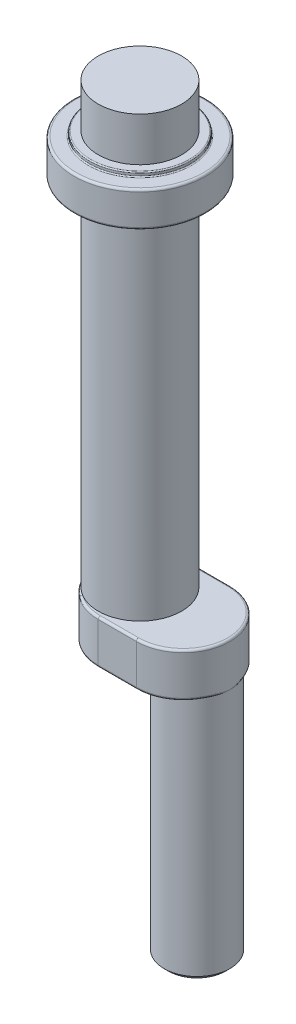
ISO-10303-21;
HEADER;
FILE_DESCRIPTION(('STEP AP214'),'2;1');
FILE_NAME('part.step','',(''),(''),'','','');
FILE_SCHEMA(('AUTOMOTIVE_DESIGN { 1 0 10303 214 1 1 1 1 }'));
ENDSEC;
DATA;
#1=APPLICATION_CONTEXT('core data for automotive mechanical design processes');
#2=APPLICATION_PROTOCOL_DEFINITION('international standard','automotive_design',2000,#1);
#3=PRODUCT_CONTEXT('',#1,'mechanical');
#4=PRODUCT('Part','Part','',(#3));
#5=PRODUCT_RELATED_PRODUCT_CATEGORY('part','',(#4));
#6=PRODUCT_DEFINITION_FORMATION('','',#4);
#7=PRODUCT_DEFINITION_CONTEXT('part definition',#1,'design');
#8=PRODUCT_DEFINITION('design','',#6,#7);
#9=PRODUCT_DEFINITION_SHAPE('','',#8);
#10=(LENGTH_UNIT() NAMED_UNIT(*) SI_UNIT(.MILLI.,.METRE.));
#11=(NAMED_UNIT(*) PLANE_ANGLE_UNIT() SI_UNIT($,.RADIAN.));
#12=(NAMED_UNIT(*) SI_UNIT($,.STERADIAN.) SOLID_ANGLE_UNIT());
#13=UNCERTAINTY_MEASURE_WITH_UNIT(LENGTH_MEASURE(1.E-05),#10,'distance_accuracy_value','');
#14=(GEOMETRIC_REPRESENTATION_CONTEXT(3) GLOBAL_UNCERTAINTY_ASSIGNED_CONTEXT((#13)) GLOBAL_UNIT_ASSIGNED_CONTEXT((#10,
#11,#12)) REPRESENTATION_CONTEXT('',''));
#15=CARTESIAN_POINT('',(0.,0.,0.));
#16=DIRECTION('',(0.,0.,1.));
#17=DIRECTION('',(1.,0.,0.));
#18=AXIS2_PLACEMENT_3D('',#15,#16,#17);
#19=CARTESIAN_POINT('',(-4.3568347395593,5.,0.));
#20=DIRECTION('',(0.,-1.,0.));
#21=DIRECTION('',(0.,0.,1.));
#22=AXIS2_PLACEMENT_3D('',#19,#20,#21);
#23=CYLINDRICAL_SURFACE('',#22,10.6431652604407);
#24=DIRECTION('',(0.,-1.,0.));
#25=VECTOR('',#24,1.);
#26=CARTESIAN_POINT('',(-4.3568347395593,5.,10.6431652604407));
#27=LINE('',#26,#25);
#28=CARTESIAN_POINT('',(-4.3568347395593,4.5,10.6431652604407));
#29=VERTEX_POINT('',#28);
#30=CARTESIAN_POINT('',(-4.3568347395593,-4.5,10.6431652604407));
#31=VERTEX_POINT('',#30);
#32=EDGE_CURVE('E350',#29,#31,#27,.T.);
#33=ORIENTED_EDGE('',*,*,#32,.F.);
#34=CARTESIAN_POINT('',(-4.3568347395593,4.5,0.));
#35=DIRECTION('',(0.,1.,0.));
#36=DIRECTION('',(0.,0.,1.));
#37=AXIS2_PLACEMENT_3D('',#34,#35,#36);
#38=CIRCLE('',#37,10.6431652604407);
#39=CARTESIAN_POINT('',(-10.7547817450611,4.5,8.50548298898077));
#40=VERTEX_POINT('',#39);
#41=EDGE_CURVE('E367',#40,#29,#38,.T.);
#42=ORIENTED_EDGE('',*,*,#41,.F.);
#43=CARTESIAN_POINT('',(-7.18734187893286,5.,9.34895060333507));
#44=CARTESIAN_POINT('',(-7.284103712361,5.25730088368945,9.5585064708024));
#45=CARTESIAN_POINT('',(-7.36165409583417,5.1361801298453,9.87282471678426));
#46=CARTESIAN_POINT('',(-7.43920447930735,5.01505937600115,10.1871429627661));
#47=CARTESIAN_POINT('',(-7.397232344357,4.67218612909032,10.1996543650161));
#48=CARTESIAN_POINT('',(-7.24737761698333,5.,9.33811538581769));
#49=CARTESIAN_POINT('',(-7.34375417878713,5.24976797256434,9.55057746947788));
#50=CARTESIAN_POINT('',(-7.42247973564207,5.12650383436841,9.85949316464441));
#51=CARTESIAN_POINT('',(-7.50077031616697,5.00330580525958,10.1685070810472));
#52=CARTESIAN_POINT('',(-7.46141185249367,4.6640431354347,10.1805235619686));
#53=CARTESIAN_POINT('',(-7.30743322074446,5.,9.32667881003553));
#54=CARTESIAN_POINT('',(-7.40388161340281,5.24246184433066,9.54155869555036));
#55=CARTESIAN_POINT('',(-7.48350577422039,5.11728176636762,9.8452996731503));
#56=CARTESIAN_POINT('',(-7.56272449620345,4.99215948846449,10.1491408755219));
#57=CARTESIAN_POINT('',(-7.52547297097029,4.65641928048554,10.1607677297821));
#58=CARTESIAN_POINT('',(-7.4275343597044,5.,9.30259968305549));
#59=CARTESIAN_POINT('',(-7.52442212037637,5.22831713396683,9.52154544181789));
#60=CARTESIAN_POINT('',(-7.60577755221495,5.0996281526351,9.81528149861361));
#61=CARTESIAN_POINT('',(-7.68672551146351,4.97099873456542,10.1091169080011));
#62=CARTESIAN_POINT('',(-7.65330659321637,4.64206096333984,10.1200167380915));
#63=CARTESIAN_POINT('',(-7.48757989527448,5.,9.28995719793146));
#64=CARTESIAN_POINT('',(-7.58486706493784,5.22147147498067,9.51055851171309));
#65=CARTESIAN_POINT('',(-7.66702327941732,5.09119656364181,9.7994569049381));
#66=CARTESIAN_POINT('',(-7.74880647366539,4.96097083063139,10.0884565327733));
#67=CARTESIAN_POINT('',(-7.71707911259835,4.63532645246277,10.0990216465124));
#68=CARTESIAN_POINT('',(-7.66761026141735,5.,9.25021992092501));
#69=CARTESIAN_POINT('',(-7.76578762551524,5.20162271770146,9.47497844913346));
#70=CARTESIAN_POINT('',(-7.85080155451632,5.06691267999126,9.74968042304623));
#71=CARTESIAN_POINT('',(-7.9343336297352,4.93239867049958,10.0247833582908));
#72=CARTESIAN_POINT('',(-7.90786866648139,4.61623518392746,10.034199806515));
#73=CARTESIAN_POINT('',(-7.78751521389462,5.,9.22131056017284));
#74=CARTESIAN_POINT('',(-7.88713225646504,5.18915151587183,9.44757894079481));
#75=CARTESIAN_POINT('',(-7.9734020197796,5.05206713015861,9.71341990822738));
#76=CARTESIAN_POINT('',(-8.05838708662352,4.91512835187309,9.97967128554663));
#77=CARTESIAN_POINT('',(-8.03438587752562,4.60498725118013,9.98852809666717));
#78=CARTESIAN_POINT('',(-8.02673530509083,5.,9.15865113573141));
#79=CARTESIAN_POINT('',(-8.12931410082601,5.1656045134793,9.3862166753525));
#80=CARTESIAN_POINT('',(-8.21791693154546,5.02448246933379,9.63519090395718));
#81=CARTESIAN_POINT('',(-8.30525416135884,4.88350253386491,9.88457064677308));
#82=CARTESIAN_POINT('',(-8.28570737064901,4.58476645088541,9.89237189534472));
#83=CARTESIAN_POINT('',(-8.14605068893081,5.,9.12490329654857));
#84=CARTESIAN_POINT('',(-8.25030865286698,5.15449891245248,9.35228615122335));
#85=CARTESIAN_POINT('',(-8.33983166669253,5.01174239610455,9.59322503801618));
#86=CARTESIAN_POINT('',(-8.42823594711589,4.86909579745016,9.83457498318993));
#87=CARTESIAN_POINT('',(-8.41051241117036,4.57579254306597,9.8418896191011));
#88=CARTESIAN_POINT('',(-8.38389146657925,5.,9.05254811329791));
#89=CARTESIAN_POINT('',(-8.49138223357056,5.13347312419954,9.27829472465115));
#90=CARTESIAN_POINT('',(-8.5825443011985,4.98799457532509,9.50384112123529));
#91=CARTESIAN_POINT('',(-8.67260195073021,4.84262363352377,9.7297951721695));
#92=CARTESIAN_POINT('',(-8.65822753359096,4.55970344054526,9.73617628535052));
#93=CARTESIAN_POINT('',(-8.50241681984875,5.,9.01394052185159));
#94=CARTESIAN_POINT('',(-8.61158612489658,5.12353206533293,9.23825338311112));
#95=CARTESIAN_POINT('',(-8.70334214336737,4.97698691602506,9.45642279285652));
#96=CARTESIAN_POINT('',(-8.7941187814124,4.83052426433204,9.67500357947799));
#97=CARTESIAN_POINT('',(-8.78113751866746,4.55258834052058,9.68094498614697));
#98=CARTESIAN_POINT('',(-8.85606740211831,5.,8.89095124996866));
#99=CARTESIAN_POINT('',(-8.96840605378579,5.09541048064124,9.11006333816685));
#100=CARTESIAN_POINT('',(-9.06310509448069,4.94619739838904,9.30645525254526));
#101=CARTESIAN_POINT('',(-9.15390940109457,4.79732024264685,9.50446453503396));
#102=CARTESIAN_POINT('',(-9.14630306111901,4.53361544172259,9.50843462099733));
#103=CARTESIAN_POINT('',(-9.089690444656,5.,8.79929267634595));
#104=CARTESIAN_POINT('',(-9.20516533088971,5.078570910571,9.0127744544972));
#105=CARTESIAN_POINT('',(-9.29987339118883,4.92860244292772,9.19605405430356));
#106=CARTESIAN_POINT('',(-9.39142478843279,4.77884479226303,9.38095935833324));
#107=CARTESIAN_POINT('',(-9.38543868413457,4.52409667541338,9.38416904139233));
#108=CARTESIAN_POINT('',(-9.5509842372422,5.,8.59668646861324));
#109=CARTESIAN_POINT('',(-9.67082298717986,5.04830501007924,8.79671061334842));
#110=CARTESIAN_POINT('',(-9.76516751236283,4.89796678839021,8.95557642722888));
#111=CARTESIAN_POINT('',(-9.85642368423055,4.74782897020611,9.11604406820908));
#112=CARTESIAN_POINT('',(-9.85370547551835,4.50992202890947,9.11778355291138));
#113=CARTESIAN_POINT('',(-9.77865428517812,5.,8.48573657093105));
#114=CARTESIAN_POINT('',(-9.90031198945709,5.03480216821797,8.67799174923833));
#115=CARTESIAN_POINT('',(-9.99369236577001,4.88492662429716,8.8254976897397));
#116=CARTESIAN_POINT('',(-10.0845256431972,4.7351781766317,8.97459187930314));
#117=CARTESIAN_POINT('',(-10.0828354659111,4.5052667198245,8.97566154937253));
#118=CARTESIAN_POINT('',(-10.2258502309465,5.,8.2450404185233));
#119=CARTESIAN_POINT('',(-10.3492057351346,5.01073147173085,8.42063449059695));
#120=CARTESIAN_POINT('',(-10.4402837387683,4.86265525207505,8.54698850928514));
#121=CARTESIAN_POINT('',(-10.5288542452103,4.71470400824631,8.67490648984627));
#122=CARTESIAN_POINT('',(-10.5292845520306,4.50001488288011,8.67468524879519));
#123=CARTESIAN_POINT('',(-10.4453901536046,5.,8.11532862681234));
#124=CARTESIAN_POINT('',(-10.569089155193,5.00010690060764,8.28205495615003));
#125=CARTESIAN_POINT('',(-10.658368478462,4.85341717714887,8.39859178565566));
#126=CARTESIAN_POINT('',(-10.7455792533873,4.70680216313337,8.51665864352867));
#127=CARTESIAN_POINT('',(-10.7466243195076,4.49941100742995,8.51586177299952));
#128=CARTESIAN_POINT('',(-10.8749664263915,5.,7.83742160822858));
#129=CARTESIAN_POINT('',(-10.9974940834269,4.98140314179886,7.98606266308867));
#130=CARTESIAN_POINT('',(-11.0828898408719,4.8381788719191,8.08434424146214));
#131=CARTESIAN_POINT('',(-11.1662415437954,4.6950275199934,8.18414009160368));
#132=CARTESIAN_POINT('',(-11.1686209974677,4.50167446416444,8.18222980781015));
#133=CARTESIAN_POINT('',(-11.0850032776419,5.,7.68922735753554));
#134=CARTESIAN_POINT('',(-11.2064010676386,4.97328734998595,7.8286410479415));
#135=CARTESIAN_POINT('',(-11.2893270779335,4.83217847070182,7.91849434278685));
#136=CARTESIAN_POINT('',(-11.3705730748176,4.69110826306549,8.00980989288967));
#137=CARTESIAN_POINT('',(-11.3732785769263,4.50454161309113,8.00742216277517));
#138=CARTESIAN_POINT('',(-11.4938803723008,5.,7.37495046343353));
#139=CARTESIAN_POINT('',(-11.6113439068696,4.95931612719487,7.49615073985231));
#140=CARTESIAN_POINT('',(-11.6891517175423,4.82300652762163,7.57040995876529));
#141=CARTESIAN_POINT('',(-11.7652942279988,4.68673499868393,7.64611932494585));
#142=CARTESIAN_POINT('',(-11.7687703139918,4.51331715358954,7.64280897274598));
#143=CARTESIAN_POINT('',(-11.6927182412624,5.,7.20886404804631));
#144=CARTESIAN_POINT('',(-11.8077054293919,4.95343476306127,7.32104296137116));
#145=CARTESIAN_POINT('',(-11.8825363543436,4.81983558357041,7.38817201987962));
#146=CARTESIAN_POINT('',(-11.9560125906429,4.68625055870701,7.45668162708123));
#147=CARTESIAN_POINT('',(-11.9596015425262,4.51922618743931,7.45300026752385));
#148=CARTESIAN_POINT('',(-12.0774337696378,5.,6.85965462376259));
#149=CARTESIAN_POINT('',(-12.1860505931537,4.9436936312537,6.95448913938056));
#150=CARTESIAN_POINT('',(-12.2548722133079,4.81598933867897,7.00852615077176));
#151=CARTESIAN_POINT('',(-12.3223502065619,4.68829876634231,7.06393389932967));
#152=CARTESIAN_POINT('',(-12.3262925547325,4.53372962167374,7.05953526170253));
#153=CARTESIAN_POINT('',(-12.2633109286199,5.,6.67653095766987));
#154=CARTESIAN_POINT('',(-12.3683177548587,4.93981474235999,6.76298508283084));
#155=CARTESIAN_POINT('',(-12.4338228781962,4.81531413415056,6.81111763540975));
#156=CARTESIAN_POINT('',(-12.4982524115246,4.69081079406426,6.86053570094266));
#157=CARTESIAN_POINT('',(-12.502151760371,4.54232412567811,6.85587842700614));
#158=CARTESIAN_POINT('',(-12.6379161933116,5.,6.27555518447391));
#159=CARTESIAN_POINT('',(-12.7340758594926,4.93357168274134,6.34564069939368));
#160=CARTESIAN_POINT('',(-12.7928126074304,4.8162087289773,6.38238884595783));
#161=CARTESIAN_POINT('',(-12.8502607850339,4.69884262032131,6.4206748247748));
#162=CARTESIAN_POINT('',(-12.8543196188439,4.56284373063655,6.41535741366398));
#163=CARTESIAN_POINT('',(-12.8251453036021,5.,6.05605818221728));
#164=CARTESIAN_POINT('',(-12.9163782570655,4.93137327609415,6.1180359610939));
#165=CARTESIAN_POINT('',(-12.9712465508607,4.8180045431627,6.14964017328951));
#166=CARTESIAN_POINT('',(-13.0251308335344,4.70461871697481,6.18264852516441));
#167=CARTESIAN_POINT('',(-13.0289902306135,4.57501235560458,6.1771934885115));
#168=CARTESIAN_POINT('',(-13.1798184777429,5.,5.59945819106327));
#169=CARTESIAN_POINT('',(-13.2602978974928,4.92888098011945,5.64677509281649));
#170=CARTESIAN_POINT('',(-13.307715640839,4.82389708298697,5.6692514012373));
#171=CARTESIAN_POINT('',(-13.3541567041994,4.7188959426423,5.69312291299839));
#172=CARTESIAN_POINT('',(-13.3578141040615,4.60182582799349,5.68738283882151));
#173=CARTESIAN_POINT('',(-13.3472697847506,5.,5.36236169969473));
#174=CARTESIAN_POINT('',(-13.4222033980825,4.928574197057,5.40299735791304));
#175=CARTESIAN_POINT('',(-13.4657582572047,4.82799296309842,5.42161680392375));
#176=CARTESIAN_POINT('',(-13.5085939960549,4.72738696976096,5.44147757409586));
#177=CARTESIAN_POINT('',(-13.5119748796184,4.61646976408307,5.43574109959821));
#178=CARTESIAN_POINT('',(-13.6607572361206,5.,4.8720445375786));
#179=CARTESIAN_POINT('',(-13.7241774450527,4.92959924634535,4.90101107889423));
#180=CARTESIAN_POINT('',(-13.7604415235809,4.83815842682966,4.91291954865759));
#181=CARTESIAN_POINT('',(-13.7959882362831,4.7466928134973,4.92606642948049));
#182=CARTESIAN_POINT('',(-13.7990124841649,4.64789959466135,4.92030228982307));
#183=CARTESIAN_POINT('',(-13.8067649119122,5.,4.61880306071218));
#184=CARTESIAN_POINT('',(-13.8644575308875,4.93092572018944,4.64263087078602));
#185=CARTESIAN_POINT('',(-13.8970537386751,4.84423060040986,4.65183965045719));
#186=CARTESIAN_POINT('',(-13.92914898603,4.75750795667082,4.66211480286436));
#187=CARTESIAN_POINT('',(-13.9318610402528,4.66468828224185,4.65648966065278));
#188=CARTESIAN_POINT('',(-14.0753240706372,5.,4.09871215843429));
#189=CARTESIAN_POINT('',(-14.1216330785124,4.93495635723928,4.11397865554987));
#190=CARTESIAN_POINT('',(-14.1474736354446,4.85801945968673,4.11863442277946));
#191=CARTESIAN_POINT('',(-14.1728157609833,4.78105505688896,4.12435176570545));
#192=CARTESIAN_POINT('',(-14.1750962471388,4.70003578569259,4.11894508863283));
#193=CARTESIAN_POINT('',(-14.1978837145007,5.,3.83186750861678));
#194=CARTESIAN_POINT('',(-14.2387358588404,4.93765623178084,3.8435396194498));
#195=CARTESIAN_POINT('',(-14.2612892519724,4.86573557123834,3.84651297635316));
#196=CARTESIAN_POINT('',(-14.2835203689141,4.79378845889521,3.85036078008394));
#197=CARTESIAN_POINT('',(-14.2854907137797,4.7185939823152,3.84521663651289));
#198=CARTESIAN_POINT('',(-14.4196238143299,5.,3.28314790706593));
#199=CARTESIAN_POINT('',(-14.4500068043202,4.94421251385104,3.28920378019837));
#200=CARTESIAN_POINT('',(-14.4666453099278,4.88260640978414,3.28944284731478));
#201=CARTESIAN_POINT('',(-14.4829535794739,4.82097315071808,3.29057753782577));
#202=CARTESIAN_POINT('',(-14.484490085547,4.75740135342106,3.28586037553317));
#203=CARTESIAN_POINT('',(-14.5184637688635,5.,3.00111793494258));
#204=CARTESIAN_POINT('',(-14.5440116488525,4.94808335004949,3.00496706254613));
#205=CARTESIAN_POINT('',(-14.5578618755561,4.89177926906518,3.00437007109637));
#206=CARTESIAN_POINT('',(-14.5715246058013,4.8354521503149,3.00446069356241));
#207=CARTESIAN_POINT('',(-14.5727783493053,4.77767008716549,3.0001213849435));
#208=CARTESIAN_POINT('',(-14.6892965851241,5.,2.42819720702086));
#209=CARTESIAN_POINT('',(-14.706115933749,4.95668747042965,2.42904393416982));
#210=CARTESIAN_POINT('',(-14.7151984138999,4.91114864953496,2.42724322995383));
#211=CARTESIAN_POINT('',(-14.724093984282,4.8655867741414,2.42612827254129));
#212=CARTESIAN_POINT('',(-14.7249610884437,4.81930791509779,2.42241778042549));
#213=CARTESIAN_POINT('',(-14.7612994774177,5.,2.13730980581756));
#214=CARTESIAN_POINT('',(-14.7743505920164,4.96142178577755,2.1371503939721));
#215=CARTESIAN_POINT('',(-14.7813277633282,4.92134478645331,2.13519181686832));
#216=CARTESIAN_POINT('',(-14.788220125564,4.88125107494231,2.13370090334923));
#217=CARTESIAN_POINT('',(-14.7888646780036,4.8406765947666,2.13045553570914));
#218=CARTESIAN_POINT('',(-14.8774507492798,5.,1.55009990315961));
#219=CARTESIAN_POINT('',(-14.8842357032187,4.9714602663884,1.54901046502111));
#220=CARTESIAN_POINT('',(-14.8878702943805,4.94240426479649,1.54698334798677));
#221=CARTESIAN_POINT('',(-14.8914207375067,4.91333157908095,1.54542135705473));
#222=CARTESIAN_POINT('',(-14.8917786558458,4.88410911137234,1.54294544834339));
#223=CARTESIAN_POINT('',(-14.921662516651,5.,1.25379136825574));
#224=CARTESIAN_POINT('',(-14.9260306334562,4.97676604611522,1.25255731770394));
#225=CARTESIAN_POINT('',(-14.9283419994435,4.95326602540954,1.2508372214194));
#226=CARTESIAN_POINT('',(-14.930631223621,4.92975707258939,1.24935878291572));
#227=CARTESIAN_POINT('',(-14.9308456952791,4.90617124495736,1.24740734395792));
#228=CARTESIAN_POINT('',(-14.9818966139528,5.,0.658132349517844));
#229=CARTESIAN_POINT('',(-14.9829090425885,4.98767228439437,0.657293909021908));
#230=CARTESIAN_POINT('',(-14.9834557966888,4.97534033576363,0.656205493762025));
#231=CARTESIAN_POINT('',(-14.9839799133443,4.96299938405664,0.655358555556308));
#232=CARTESIAN_POINT('',(-14.9840387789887,4.95066910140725,0.654262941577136));
#233=CARTESIAN_POINT('',(-14.997938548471,5.,0.358784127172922));
#234=CARTESIAN_POINT('',(-14.9980544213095,4.99327644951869,0.35826065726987));
#235=CARTESIAN_POINT('',(-14.9981158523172,4.98655263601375,0.357721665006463));
#236=CARTESIAN_POINT('',(-14.9981762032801,4.97982826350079,0.357197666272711));
#237=CARTESIAN_POINT('',(-14.9981821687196,4.97310455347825,0.35665822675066));
#238=CARTESIAN_POINT('',(-14.9999380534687,5.,0.0396472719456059));
#239=CARTESIAN_POINT('',(-14.9999415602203,4.99925697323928,0.0395885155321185));
#240=CARTESIAN_POINT('',(-14.9999433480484,4.9985139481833,0.0395296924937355));
#241=CARTESIAN_POINT('',(-14.9999452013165,4.99777092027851,0.0394709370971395));
#242=CARTESIAN_POINT('',(-14.9999453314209,4.99702789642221,0.0394121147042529));
#243=CARTESIAN_POINT('',(-15.0000001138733,5.,0.0198233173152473));
#244=CARTESIAN_POINT('',(-15.0000001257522,4.99962849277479,0.0197939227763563));
#245=CARTESIAN_POINT('',(-15.0000000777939,4.99925698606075,0.0197645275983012));
#246=CARTESIAN_POINT('',(-15.0000001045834,4.99888547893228,0.0197351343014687));
#247=CARTESIAN_POINT('',(-15.0000000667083,4.99851397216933,0.0197057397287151));
#248=CARTESIAN_POINT('',(-15.,5.,0.));
#249=CARTESIAN_POINT('',(-15.,5.,0.));
#250=CARTESIAN_POINT('',(-15.,5.,0.));
#251=CARTESIAN_POINT('',(-15.,5.,0.));
#252=CARTESIAN_POINT('',(-15.,5.,0.));
#253=(BOUNDED_SURFACE() B_SPLINE_SURFACE(3,2,((#43,#44,#45,#46,#47),(#48,#49,#50,#51,#52),(#53,
#54,#55,#56,#57),(#58,#59,#60,#61,#62),(#63,#64,#65,#66,#67),(#68,#69,#70,#71,#72),(#73,#74,#75,
#76,#77),(#78,#79,#80,#81,#82),(#83,#84,#85,#86,#87),(#88,#89,#90,#91,#92),(#93,#94,#95,#96,
#97),(#98,#99,#100,#101,#102),(#103,#104,#105,#106,#107),(#108,#109,#110,#111,#112),(#113,#114,
#115,#116,#117),(#118,#119,#120,#121,#122),(#123,#124,#125,#126,#127),(#128,#129,#130,#131,
#132),(#133,#134,#135,#136,#137),(#138,#139,#140,#141,#142),(#143,#144,#145,#146,#147),(#148,
#149,#150,#151,#152),(#153,#154,#155,#156,#157),(#158,#159,#160,#161,#162),(#163,#164,#165,#166,
#167),(#168,#169,#170,#171,#172),(#173,#174,#175,#176,#177),(#178,#179,#180,#181,#182),(#183,
#184,#185,#186,#187),(#188,#189,#190,#191,#192),(#193,#194,#195,#196,#197),(#198,#199,#200,#201,
#202),(#203,#204,#205,#206,#207),(#208,#209,#210,#211,#212),(#213,#214,#215,#216,#217),(#218,
#219,#220,#221,#222),(#223,#224,#225,#226,#227),(#228,#229,#230,#231,#232),(#233,#234,#235,#236,
#237),(#238,#239,#240,#241,#242),(#243,#244,#245,#246,#247),(#248,#249,#250,#251,#252)),
.UNSPECIFIED.,.F.,.F.,.F.) B_SPLINE_SURFACE_WITH_KNOTS((4,2,2,2,2,2,2,2,2,2,2,2,2,2,2,2,2,2,2,2,
4),(3,2,3),(0.,0.193011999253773,0.386013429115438,0.771931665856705,1.15767304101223,
1.5434340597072,2.31359572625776,3.08384782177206,3.85270262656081,4.62151684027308,
5.39049345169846,6.15949973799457,7.003713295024,7.84761671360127,8.69263056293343,
9.53734977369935,10.3935532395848,11.2494363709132,12.1033601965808,12.9566895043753,
13.0132072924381),(0.,0.5,1.),
.UNSPECIFIED.) GEOMETRIC_REPRESENTATION_ITEM() RATIONAL_B_SPLINE_SURFACE(((1.,0.822572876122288,
1.,0.822572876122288,1.),(1.,0.825593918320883,1.,0.825593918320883,1.),(1.,0.828474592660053,
1.,0.828474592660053,1.),(1.,0.834001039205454,1.,0.834001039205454,1.),(1.,0.836646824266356,
1.,0.836646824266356,1.),(1.,0.844299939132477,1.,0.844299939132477,1.),(1.,0.849024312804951,
1.,0.849024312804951,1.),(1.,0.857925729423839,1.,0.857925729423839,1.),(1.,0.86210302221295,1.,
0.86210302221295,1.),(1.,0.870035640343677,1.,0.870035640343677,1.),(1.,0.87379094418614,1.,
0.87379094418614,1.),(1.,0.884540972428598,1.,0.884540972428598,1.),(1.,0.891034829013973,1.,
0.891034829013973,1.),(1.,0.903073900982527,1.,0.903073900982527,1.),(1.,0.908619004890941,1.,
0.908619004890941,1.),(1.,0.91896096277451,1.,0.91896096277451,1.),(1.,0.92375915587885,1.,
0.92375915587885,1.),(1.,0.932751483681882,1.,0.932751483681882,1.),(1.,0.936945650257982,1.,
0.936945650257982,1.),(1.,0.944817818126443,1.,0.944817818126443,1.),(1.,0.948495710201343,1.,
0.948495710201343,1.),(1.,0.955394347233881,1.,0.955394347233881,1.),(1.,0.958615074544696,1.,
0.958615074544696,1.),(1.,0.964936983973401,1.,0.964936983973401,1.),(1.,0.967995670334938,1.,
0.967995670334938,1.),(1.,0.973652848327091,1.,0.973652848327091,1.),(1.,0.976251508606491,1.,
0.976251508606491,1.),(1.,0.981022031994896,1.,0.981022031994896,1.),(1.,0.983193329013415,1.,
0.983193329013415,1.),(1.,0.987124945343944,1.,0.987124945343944,1.),(1.,0.988885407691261,1.,
0.988885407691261,1.),(1.,0.992032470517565,1.,0.992032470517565,1.),(1.,0.993413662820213,1.,
0.993413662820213,1.),(1.,0.995780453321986,1.,0.995780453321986,1.),(1.,0.996766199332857,1.,
0.996766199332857,1.),(1.,0.998348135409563,1.,0.998348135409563,1.),(1.,0.998945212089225,1.,
0.998945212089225,1.),(1.,0.999757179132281,1.,0.999757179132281,1.),(1.,0.999972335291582,1.,
0.999972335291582,1.),(1.,0.999999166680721,1.,0.999999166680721,1.),(1.,0.999999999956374,1.,
0.999999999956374,1.),(1.,1.,1.,1.,1.))) REPRESENTATION_ITEM('') SURFACE());
#254=CARTESIAN_POINT('',(-7.397232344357,4.67218612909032,10.1996543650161));
#255=CARTESIAN_POINT('',(-7.46141185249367,4.6640431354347,10.1805235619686));
#256=CARTESIAN_POINT('',(-7.52547297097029,4.65641928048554,10.1607677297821));
#257=CARTESIAN_POINT('',(-7.65330659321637,4.64206096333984,10.1200167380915));
#258=CARTESIAN_POINT('',(-7.71707911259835,4.63532645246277,10.0990216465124));
#259=CARTESIAN_POINT('',(-7.90786866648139,4.61623518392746,10.034199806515));
#260=CARTESIAN_POINT('',(-8.03438587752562,4.60498725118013,9.98852809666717));
#261=CARTESIAN_POINT('',(-8.28570737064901,4.58476645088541,9.89237189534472));
#262=CARTESIAN_POINT('',(-8.41051241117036,4.57579254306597,9.8418896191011));
#263=CARTESIAN_POINT('',(-8.65822753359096,4.55970344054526,9.73617628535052));
#264=CARTESIAN_POINT('',(-8.78113751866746,4.55258834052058,9.68094498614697));
#265=CARTESIAN_POINT('',(-9.146303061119,4.53361544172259,9.50843462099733));
#266=CARTESIAN_POINT('',(-9.38543868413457,4.52409667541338,9.38416904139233));
#267=CARTESIAN_POINT('',(-9.85370547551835,4.50992202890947,9.11778355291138));
#268=CARTESIAN_POINT('',(-10.0828354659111,4.5052667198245,8.97566154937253));
#269=CARTESIAN_POINT('',(-10.5292845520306,4.50001488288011,8.67468524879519));
#270=CARTESIAN_POINT('',(-10.7466243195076,4.49941100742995,8.51586177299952));
#271=CARTESIAN_POINT('',(-11.1686209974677,4.50167446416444,8.18222980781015));
#272=CARTESIAN_POINT('',(-11.3732785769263,4.50454161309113,8.00742216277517));
#273=CARTESIAN_POINT('',(-11.7687703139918,4.51331715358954,7.64280897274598));
#274=CARTESIAN_POINT('',(-11.9596015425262,4.51922618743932,7.45300026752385));
#275=CARTESIAN_POINT('',(-12.3262925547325,4.53372962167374,7.05953526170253));
#276=CARTESIAN_POINT('',(-12.502151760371,4.54232412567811,6.85587842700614));
#277=CARTESIAN_POINT('',(-12.8543196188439,4.56284373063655,6.41535741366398));
#278=CARTESIAN_POINT('',(-13.0289902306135,4.57501235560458,6.1771934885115));
#279=CARTESIAN_POINT('',(-13.3578141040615,4.60182582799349,5.68738283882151));
#280=CARTESIAN_POINT('',(-13.5119748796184,4.61646976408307,5.43574109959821));
#281=CARTESIAN_POINT('',(-13.7990124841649,4.64789959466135,4.92030228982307));
#282=CARTESIAN_POINT('',(-13.9318610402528,4.66468828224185,4.65648966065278));
#283=CARTESIAN_POINT('',(-14.1750962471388,4.70003578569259,4.11894508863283));
#284=CARTESIAN_POINT('',(-14.2854907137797,4.7185939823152,3.84521663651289));
#285=CARTESIAN_POINT('',(-14.484490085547,4.75740135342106,3.28586037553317));
#286=CARTESIAN_POINT('',(-14.5727783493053,4.77767008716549,3.0001213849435));
#287=CARTESIAN_POINT('',(-14.7249610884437,4.81930791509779,2.42241778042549));
#288=CARTESIAN_POINT('',(-14.7888646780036,4.8406765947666,2.13045553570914));
#289=CARTESIAN_POINT('',(-14.8917786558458,4.88410911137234,1.54294544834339));
#290=CARTESIAN_POINT('',(-14.9308456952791,4.90617124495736,1.24740734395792));
#291=CARTESIAN_POINT('',(-14.9840387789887,4.95066910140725,0.654262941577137));
#292=CARTESIAN_POINT('',(-14.9981821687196,4.97310455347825,0.356658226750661));
#293=CARTESIAN_POINT('',(-14.9999453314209,4.99702789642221,0.039412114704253));
#294=CARTESIAN_POINT('',(-15.0000000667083,4.99851397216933,0.0197057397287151));
#295=CARTESIAN_POINT('',(-15.,5.,0.));
#296=B_SPLINE_CURVE_WITH_KNOTS('',3,(#254,#255,#256,#257,#258,#259,#260,#261,#262,#263,#264,
#265,#266,#267,#268,#269,#270,#271,#272,#273,#274,#275,#276,#277,#278,#279,#280,#281,#282,#283,
#284,#285,#286,#287,#288,#289,#290,#291,#292,#293,#294,#295),.UNSPECIFIED.,.F.,.F.,(4,2,2,2,2,2,
2,2,2,2,2,2,2,2,2,2,2,2,2,2,4),(0.,0.193011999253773,0.386013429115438,0.771931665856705,
1.15767304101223,1.5434340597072,2.31359572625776,3.08384782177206,3.85270262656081,
4.62151684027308,5.39049345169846,6.15949973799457,7.003713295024,7.84761671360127,
8.69263056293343,9.53734977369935,10.3935532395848,11.2494363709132,12.1033601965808,
12.9566895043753,13.0132072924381),.UNSPECIFIED.);
#297=CARTESIAN_POINT('',(-15.,5.,0.));
#298=VERTEX_POINT('',#297);
#299=EDGE_CURVE('E369',#298,#40,#296,.F.);
#300=ORIENTED_EDGE('',*,*,#299,.F.);
#301=CARTESIAN_POINT('',(-7.39723234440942,4.67218612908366,-10.1996543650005));
#302=CARTESIAN_POINT('',(-7.43920448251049,5.01505937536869,-10.1871429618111));
#303=CARTESIAN_POINT('',(-7.36165410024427,5.13618012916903,-9.87282471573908));
#304=CARTESIAN_POINT('',(-7.28410371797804,5.25730088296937,-9.55850646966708));
#305=CARTESIAN_POINT('',(-7.18734188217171,5.,-9.34895060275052));
#306=CARTESIAN_POINT('',(-7.46141185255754,4.66404313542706,-10.1805235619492));
#307=CARTESIAN_POINT('',(-7.5007703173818,5.00330580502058,-10.1685070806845));
#308=CARTESIAN_POINT('',(-7.42247973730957,5.12650383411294,-9.85949316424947));
#309=CARTESIAN_POINT('',(-7.343754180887,5.24976797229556,-9.55057746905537));
#310=CARTESIAN_POINT('',(-7.24737761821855,5.,-9.33811538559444));
#311=CARTESIAN_POINT('',(-7.52547297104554,4.65641928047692,-10.1607677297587));
#312=CARTESIAN_POINT('',(-7.56272449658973,4.99215948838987,-10.1491408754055));
#313=CARTESIAN_POINT('',(-7.48350577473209,5.11728176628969,-9.84529967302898));
#314=CARTESIAN_POINT('',(-7.40388161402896,5.24246184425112,-9.54155869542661));
#315=CARTESIAN_POINT('',(-7.30743322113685,5.,-9.32667880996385));
#316=CARTESIAN_POINT('',(-7.65330659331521,4.64206096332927,-10.1200167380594));
#317=CARTESIAN_POINT('',(-7.68672551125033,4.9709987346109,-10.1091169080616));
#318=CARTESIAN_POINT('',(-7.60577755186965,5.09962815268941,-9.81528149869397));
#319=CARTESIAN_POINT('',(-7.52442211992,5.22831713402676,-9.52154544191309));
#320=CARTESIAN_POINT('',(-7.42753435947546,5.,-9.3025996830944));
#321=CARTESIAN_POINT('',(-7.71707911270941,4.63532645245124,-10.0990216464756));
#322=CARTESIAN_POINT('',(-7.74880647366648,4.96097083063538,-10.0884565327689));
#323=CARTESIAN_POINT('',(-7.66702327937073,5.09119656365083,-9.79945690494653));
#324=CARTESIAN_POINT('',(-7.58486706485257,5.22147147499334,-9.51055851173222));
#325=CARTESIAN_POINT('',(-7.48757989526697,5.,-9.28995719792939));
#326=CARTESIAN_POINT('',(-7.90786866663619,4.61623518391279,-10.0341998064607));
#327=CARTESIAN_POINT('',(-7.93433363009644,4.93239867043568,-10.0247833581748));
#328=CARTESIAN_POINT('',(-7.85080155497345,5.06691267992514,-9.74968042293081));
#329=CARTESIAN_POINT('',(-7.76578762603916,5.2016227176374,-9.4749784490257));
#330=CARTESIAN_POINT('',(-7.66761026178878,5.,-9.25021992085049));
#331=CARTESIAN_POINT('',(-8.03438587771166,4.60498725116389,-9.98852809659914));
#332=CARTESIAN_POINT('',(-8.0583870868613,4.91512835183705,-9.97967128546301));
#333=CARTESIAN_POINT('',(-7.97340202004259,5.05206713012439,-9.71341990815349));
#334=CARTESIAN_POINT('',(-7.88713225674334,5.18915151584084,-9.44757894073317));
#335=CARTESIAN_POINT('',(-7.78751521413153,5.,-9.22131056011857));
#336=CARTESIAN_POINT('',(-8.28570737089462,4.58476645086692,-9.89237189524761));
#337=CARTESIAN_POINT('',(-8.30525416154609,4.88350253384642,-9.88457064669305));
#338=CARTESIAN_POINT('',(-8.21791693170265,5.0244824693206,-9.63519090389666));
#339=CARTESIAN_POINT('',(-8.12931410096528,5.16560451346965,-9.38621667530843));
#340=CARTESIAN_POINT('',(-8.02673530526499,5.,-9.15865113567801));
#341=CARTESIAN_POINT('',(-8.41051241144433,4.57579254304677,-9.8418896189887));
#342=CARTESIAN_POINT('',(-8.42823594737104,4.86909579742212,-9.83457498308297));
#343=CARTESIAN_POINT('',(-8.33983166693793,5.01174239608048,-9.59322503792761));
#344=CARTESIAN_POINT('',(-8.25030865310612,5.15449891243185,-9.35228615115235));
#345=CARTESIAN_POINT('',(-8.14605068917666,5.,-9.12490329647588));
#346=CARTESIAN_POINT('',(-8.65822753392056,4.55970344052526,-9.73617628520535));
#347=CARTESIAN_POINT('',(-8.67260195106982,4.84262363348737,-9.72979517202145));
#348=CARTESIAN_POINT('',(-8.5825443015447,4.98799457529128,-9.50384112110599));
#349=CARTESIAN_POINT('',(-8.49138223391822,5.133473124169,-9.27829472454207));
#350=CARTESIAN_POINT('',(-8.38389146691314,5.,-9.05254811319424));
#351=CARTESIAN_POINT('',(-8.78113751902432,4.5525883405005,-9.68094498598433));
#352=CARTESIAN_POINT('',(-8.79411878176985,4.83052426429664,-9.67500357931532));
#353=CARTESIAN_POINT('',(-8.70334214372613,4.9769869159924,-9.45642279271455));
#354=CARTESIAN_POINT('',(-8.61158612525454,5.12353206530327,-9.23825338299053));
#355=CARTESIAN_POINT('',(-8.50241682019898,5.,-9.01394052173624));
#356=CARTESIAN_POINT('',(-9.14630306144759,4.53361544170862,-9.50843462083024));
#357=CARTESIAN_POINT('',(-9.15390940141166,4.79732024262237,-9.50446453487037));
#358=CARTESIAN_POINT('',(-9.06310509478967,4.94619739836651,-9.30645525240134));
#359=CARTESIAN_POINT('',(-8.96840605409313,5.09541048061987,-9.11006333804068));
#360=CARTESIAN_POINT('',(-8.85606740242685,5.,-8.89095124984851));
#361=CARTESIAN_POINT('',(-9.38543868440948,4.5240966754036,-9.38416904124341));
#362=CARTESIAN_POINT('',(-9.39142478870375,4.77884479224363,-9.38095935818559));
#363=CARTESIAN_POINT('',(-9.29987339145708,4.92860244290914,-9.19605405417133));
#364=CARTESIAN_POINT('',(-9.2051653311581,5.07857091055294,-9.01277445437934));
#365=CARTESIAN_POINT('',(-9.08969044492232,5.,-8.79929267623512));
#366=CARTESIAN_POINT('',(-9.8537054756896,4.50992202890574,-9.11778355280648));
#367=CARTESIAN_POINT('',(-9.85642368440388,4.74782897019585,-9.1160440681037));
#368=CARTESIAN_POINT('',(-9.7651675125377,4.89796678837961,-8.95557642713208));
#369=CARTESIAN_POINT('',(-9.6708229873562,5.04830501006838,-8.79671061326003));
#370=CARTESIAN_POINT('',(-9.55098423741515,5.,-8.59668646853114));
#371=CARTESIAN_POINT('',(-10.0828354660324,4.50526671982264,-8.97566154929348));
#372=CARTESIAN_POINT('',(-10.084525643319,4.73517817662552,-8.97459187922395));
#373=CARTESIAN_POINT('',(-9.99369236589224,4.88492662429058,-8.82549768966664));
#374=CARTESIAN_POINT('',(-9.90031198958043,5.034802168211,-8.67799174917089));
#375=CARTESIAN_POINT('',(-9.77865428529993,5.,-8.48573657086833));
#376=CARTESIAN_POINT('',(-10.5292845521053,4.50001488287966,-8.67468524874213));
#377=CARTESIAN_POINT('',(-10.5288542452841,4.71470400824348,-8.67490648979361));
#378=CARTESIAN_POINT('',(-10.440283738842,4.86265525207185,-8.54698850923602));
#379=CARTESIAN_POINT('',(-10.3492057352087,5.01073147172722,-8.42063449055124));
#380=CARTESIAN_POINT('',(-10.2258502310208,5.,-8.24504041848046));
#381=CARTESIAN_POINT('',(-10.7466243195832,4.49941100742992,-8.51586177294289));
#382=CARTESIAN_POINT('',(-10.7455792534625,4.70680216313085,-8.51665864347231));
#383=CARTESIAN_POINT('',(-10.6583684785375,4.85341717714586,-8.39859178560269));
#384=CARTESIAN_POINT('',(-10.5690891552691,5.0001069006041,-8.28205495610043));
#385=CARTESIAN_POINT('',(-10.4453901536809,5.,-8.11532862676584));
#386=CARTESIAN_POINT('',(-11.1686209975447,4.50167446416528,-8.18222980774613));
#387=CARTESIAN_POINT('',(-11.1662415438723,4.69502751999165,-8.18414009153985));
#388=CARTESIAN_POINT('',(-11.0828898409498,4.83817887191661,-8.0843442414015));
#389=CARTESIAN_POINT('',(-10.9974940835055,4.98140314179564,-7.98606266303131));
#390=CARTESIAN_POINT('',(-10.8749664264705,5.,-7.83742160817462));
#391=CARTESIAN_POINT('',(-11.3732785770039,4.50454161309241,-8.00742216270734));
#392=CARTESIAN_POINT('',(-11.370573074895,4.69110826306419,-8.00980989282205));
#393=CARTESIAN_POINT('',(-11.2893270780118,4.83217847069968,-7.91849434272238));
#394=CARTESIAN_POINT('',(-11.2064010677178,4.97328734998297,-7.82864104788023));
#395=CARTESIAN_POINT('',(-11.0850032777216,5.,-7.68922735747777));
#396=CARTESIAN_POINT('',(-11.7687703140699,4.51331715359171,-7.64280897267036));
#397=CARTESIAN_POINT('',(-11.7652942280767,4.6867349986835,-7.6461193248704));
#398=CARTESIAN_POINT('',(-11.6891517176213,4.82300652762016,-7.5704099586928));
#399=CARTESIAN_POINT('',(-11.6113439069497,4.95931612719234,-7.4961507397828));
#400=CARTESIAN_POINT('',(-11.4938803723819,5.,-7.37495046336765));
#401=CARTESIAN_POINT('',(-11.9596015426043,4.51922618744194,-7.45300026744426));
#402=CARTESIAN_POINT('',(-11.956012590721,4.686250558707,-7.45668162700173));
#403=CARTESIAN_POINT('',(-11.8825363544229,4.81983558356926,-7.38817201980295));
#404=CARTESIAN_POINT('',(-11.8077054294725,4.95343476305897,-7.32104296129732));
#405=CARTESIAN_POINT('',(-11.6927182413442,5.,-7.20886404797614));
#406=CARTESIAN_POINT('',(-12.3262925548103,4.53372962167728,-7.05953526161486));
#407=CARTESIAN_POINT('',(-12.3223502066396,4.68829876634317,-7.06393389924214));
#408=CARTESIAN_POINT('',(-12.254872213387,4.81598933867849,-7.00852615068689));
#409=CARTESIAN_POINT('',(-12.1860505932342,4.94369363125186,-6.95448913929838));
#410=CARTESIAN_POINT('',(-12.0774337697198,5.,-6.85965462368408));
#411=CARTESIAN_POINT('',(-12.5021517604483,4.54232412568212,-6.85587842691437));
#412=CARTESIAN_POINT('',(-12.4982524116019,4.69081079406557,-6.86053570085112));
#413=CARTESIAN_POINT('',(-12.4338228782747,4.81531413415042,-6.81111763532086));
#414=CARTESIAN_POINT('',(-12.3683177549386,4.93981474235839,-6.7629850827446));
#415=CARTESIAN_POINT('',(-12.2633109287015,5.,-6.67653095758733));
#416=CARTESIAN_POINT('',(-12.854319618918,4.56284373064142,-6.41535741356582));
#417=CARTESIAN_POINT('',(-12.850260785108,4.69884262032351,-6.42067482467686));
#418=CARTESIAN_POINT('',(-12.7928126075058,4.81620872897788,-6.38238884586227));
#419=CARTESIAN_POINT('',(-12.7340758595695,4.93357168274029,-6.34564069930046));
#420=CARTESIAN_POINT('',(-12.6379161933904,5.,-6.27555518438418));
#421=CARTESIAN_POINT('',(-13.0289902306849,4.57501235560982,-6.17719348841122));
#422=CARTESIAN_POINT('',(-13.0251308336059,4.70461871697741,-6.1826485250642));
#423=CARTESIAN_POINT('',(-12.9712465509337,4.81800454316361,-6.1496401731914));
#424=CARTESIAN_POINT('',(-12.91637825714,4.93137327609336,-6.11803596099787));
#425=CARTESIAN_POINT('',(-12.8251453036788,5.,-6.05605818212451));
#426=CARTESIAN_POINT('',(-13.3578141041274,4.60182582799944,-5.68738283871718));
#427=CARTESIAN_POINT('',(-13.3541567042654,4.71889594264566,-5.69312291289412));
#428=CARTESIAN_POINT('',(-13.3077156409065,4.82389708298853,-5.6692514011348));
#429=CARTESIAN_POINT('',(-13.2602978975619,4.92888098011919,-5.64677509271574));
#430=CARTESIAN_POINT('',(-13.1798184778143,5.,-5.59945819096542));
#431=CARTESIAN_POINT('',(-13.5119748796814,4.61646976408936,-5.43574109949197));
#432=CARTESIAN_POINT('',(-13.5085939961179,4.72738696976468,-5.44147757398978));
#433=CARTESIAN_POINT('',(-13.4657582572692,4.82799296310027,-5.42161680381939));
#434=CARTESIAN_POINT('',(-13.4222033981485,4.92857419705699,-5.40299735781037));
#435=CARTESIAN_POINT('',(-13.347269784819,5.,-5.36236169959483));
#436=CARTESIAN_POINT('',(-13.7990124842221,4.64789959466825,-4.92030228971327));
#437=CARTESIAN_POINT('',(-13.7959882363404,4.74669281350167,-4.9260664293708));
#438=CARTESIAN_POINT('',(-13.7604415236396,4.83815842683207,-4.91291954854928));
#439=CARTESIAN_POINT('',(-13.7241774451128,4.9295992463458,-4.90101107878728));
#440=CARTESIAN_POINT('',(-13.660757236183,5.,-4.87204453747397));
#441=CARTESIAN_POINT('',(-13.931861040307,4.66468828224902,-4.65648966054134));
#442=CARTESIAN_POINT('',(-13.9291489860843,4.75750795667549,-4.66211480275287));
#443=CARTESIAN_POINT('',(-13.8970537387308,4.84423060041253,-4.6518396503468));
#444=CARTESIAN_POINT('',(-13.8644575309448,4.9309257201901,-4.64263087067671));
#445=CARTESIAN_POINT('',(-13.8067649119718,5.,-4.61880306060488));
#446=CARTESIAN_POINT('',(-14.1750962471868,4.70003578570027,-4.11894508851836));
#447=CARTESIAN_POINT('',(-14.1728157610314,4.78105505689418,-4.12435176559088));
#448=CARTESIAN_POINT('',(-14.1474736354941,4.85801945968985,-4.11863442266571));
#449=CARTESIAN_POINT('',(-14.1216330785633,4.93495635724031,-4.11397865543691));
#450=CARTESIAN_POINT('',(-14.0753240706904,5.,-4.09871215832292));
#451=CARTESIAN_POINT('',(-14.2854907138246,4.7185939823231,-3.84521663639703));
#452=CARTESIAN_POINT('',(-14.2835203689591,4.79378845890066,-3.8503607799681));
#453=CARTESIAN_POINT('',(-14.2612892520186,4.86573557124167,-3.84651297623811));
#454=CARTESIAN_POINT('',(-14.2387358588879,4.93765623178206,-3.84353961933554));
#455=CARTESIAN_POINT('',(-14.1978837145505,5.,-3.831867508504));
#456=CARTESIAN_POINT('',(-14.4844900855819,4.75740135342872,-3.28586037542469));
#457=CARTESIAN_POINT('',(-14.4829535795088,4.82097315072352,-3.29057753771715));
#458=CARTESIAN_POINT('',(-14.4666453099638,4.88260640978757,-3.28944284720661));
#459=CARTESIAN_POINT('',(-14.4500068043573,4.94421251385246,-3.28920378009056));
#460=CARTESIAN_POINT('',(-14.4196238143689,5.,-3.28314790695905));
#461=CARTESIAN_POINT('',(-14.5727783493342,4.77767008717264,-3.00012138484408));
#462=CARTESIAN_POINT('',(-14.5715246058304,4.83545215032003,-3.00446069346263));
#463=CARTESIAN_POINT('',(-14.557861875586,4.89177926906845,-3.00437007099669));
#464=CARTESIAN_POINT('',(-14.5440116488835,4.94808335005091,-3.00496706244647));
#465=CARTESIAN_POINT('',(-14.5184637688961,5.,-3.00111793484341));
#466=CARTESIAN_POINT('',(-14.7249610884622,4.81930791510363,-2.42241778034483));
#467=CARTESIAN_POINT('',(-14.7240939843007,4.86558677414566,-2.42612827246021));
#468=CARTESIAN_POINT('',(-14.7151984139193,4.91114864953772,-2.42724322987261));
#469=CARTESIAN_POINT('',(-14.706115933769,4.95668747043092,-2.42904393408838));
#470=CARTESIAN_POINT('',(-14.6892965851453,5.,-2.42819720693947));
#471=CARTESIAN_POINT('',(-14.7888646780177,4.84067659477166,-2.13045553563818));
#472=CARTESIAN_POINT('',(-14.7882201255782,4.88125107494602,-2.13370090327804));
#473=CARTESIAN_POINT('',(-14.7813277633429,4.92134478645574,-2.13519181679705));
#474=CARTESIAN_POINT('',(-14.7743505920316,4.96142178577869,-2.13715039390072));
#475=CARTESIAN_POINT('',(-14.7612994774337,5.,-2.13730980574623));
#476=CARTESIAN_POINT('',(-14.891778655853,4.8841091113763,-1.54294544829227));
#477=CARTESIAN_POINT('',(-14.8914207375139,4.9133315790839,-1.54542135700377));
#478=CARTESIAN_POINT('',(-14.8878702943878,4.94240426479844,-1.54698334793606));
#479=CARTESIAN_POINT('',(-14.8842357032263,4.97146026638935,-1.5490104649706));
#480=CARTESIAN_POINT('',(-14.8774507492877,5.,-1.55009990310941));
#481=CARTESIAN_POINT('',(-14.9308456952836,4.90617124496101,-1.24740734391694));
#482=CARTESIAN_POINT('',(-14.9306312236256,4.92975707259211,-1.24935878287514));
#483=CARTESIAN_POINT('',(-14.9283419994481,4.95326602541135,-1.25083722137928));
#484=CARTESIAN_POINT('',(-14.9260306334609,4.97676604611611,-1.25255731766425));
#485=CARTESIAN_POINT('',(-14.9216625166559,5.,-1.2537913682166));
#486=CARTESIAN_POINT('',(-14.9840387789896,4.95066910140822,-0.654262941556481));
#487=CARTESIAN_POINT('',(-14.9839799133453,4.96299938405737,-0.655358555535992));
#488=CARTESIAN_POINT('',(-14.9834557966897,4.97534033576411,-0.656205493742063));
#489=CARTESIAN_POINT('',(-14.9829090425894,4.98767228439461,-0.657293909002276));
#490=CARTESIAN_POINT('',(-14.9818966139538,5.,-0.658132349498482));
#491=CARTESIAN_POINT('',(-14.9981821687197,4.97310455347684,-0.35665822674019));
#492=CARTESIAN_POINT('',(-14.9981762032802,4.97982826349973,-0.357197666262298));
#493=CARTESIAN_POINT('',(-14.9981158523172,4.98655263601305,-0.357721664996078));
#494=CARTESIAN_POINT('',(-14.9980544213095,4.99327644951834,-0.358260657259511));
#495=CARTESIAN_POINT('',(-14.9979385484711,5.,-0.358784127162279));
#496=CARTESIAN_POINT('',(-14.9999453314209,4.99702789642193,-0.0394121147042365));
#497=CARTESIAN_POINT('',(-14.9999452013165,4.99777092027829,-0.0394709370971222));
#498=CARTESIAN_POINT('',(-14.9999433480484,4.99851394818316,-0.0395296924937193));
#499=CARTESIAN_POINT('',(-14.9999415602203,4.99925697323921,-0.0395885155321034));
#500=CARTESIAN_POINT('',(-14.9999380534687,5.,-0.0396472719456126));
#501=CARTESIAN_POINT('',(-15.0000000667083,4.99851397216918,-0.019705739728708));
#502=CARTESIAN_POINT('',(-15.0000001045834,4.99888547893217,-0.0197351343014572));
#503=CARTESIAN_POINT('',(-15.0000000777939,4.99925698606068,-0.0197645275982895));
#504=CARTESIAN_POINT('',(-15.0000001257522,4.99962849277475,-0.0197939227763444));
#505=CARTESIAN_POINT('',(-15.0000001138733,5.,-0.0198233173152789));
#506=CARTESIAN_POINT('',(-15.,5.,0.));
#507=CARTESIAN_POINT('',(-15.,5.,0.));
#508=CARTESIAN_POINT('',(-15.,5.,0.));
#509=CARTESIAN_POINT('',(-15.,5.,0.));
#510=CARTESIAN_POINT('',(-15.,5.,0.));
#511=(BOUNDED_SURFACE() B_SPLINE_SURFACE(3,2,((#301,#302,#303,#304,#305),(#306,#307,#308,#309,
#310),(#311,#312,#313,#314,#315),(#316,#317,#318,#319,#320),(#321,#322,#323,#324,#325),(#326,
#327,#328,#329,#330),(#331,#332,#333,#334,#335),(#336,#337,#338,#339,#340),(#341,#342,#343,#344,
#345),(#346,#347,#348,#349,#350),(#351,#352,#353,#354,#355),(#356,#357,#358,#359,#360),(#361,
#362,#363,#364,#365),(#366,#367,#368,#369,#370),(#371,#372,#373,#374,#375),(#376,#377,#378,#379,
#380),(#381,#382,#383,#384,#385),(#386,#387,#388,#389,#390),(#391,#392,#393,#394,#395),(#396,
#397,#398,#399,#400),(#401,#402,#403,#404,#405),(#406,#407,#408,#409,#410),(#411,#412,#413,#414,
#415),(#416,#417,#418,#419,#420),(#421,#422,#423,#424,#425),(#426,#427,#428,#429,#430),(#431,
#432,#433,#434,#435),(#436,#437,#438,#439,#440),(#441,#442,#443,#444,#445),(#446,#447,#448,#449,
#450),(#451,#452,#453,#454,#455),(#456,#457,#458,#459,#460),(#461,#462,#463,#464,#465),(#466,
#467,#468,#469,#470),(#471,#472,#473,#474,#475),(#476,#477,#478,#479,#480),(#481,#482,#483,#484,
#485),(#486,#487,#488,#489,#490),(#491,#492,#493,#494,#495),(#496,#497,#498,#499,#500),(#501,
#502,#503,#504,#505),(#506,#507,#508,#509,#510)),.UNSPECIFIED.,.F.,.F.,
.F.) B_SPLINE_SURFACE_WITH_KNOTS((4,2,2,2,2,2,2,2,2,2,2,2,2,2,2,2,2,2,2,2,4),(3,2,3),(0.,
0.193011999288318,0.386013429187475,0.771931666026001,1.15767304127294,1.5434340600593,
2.31359572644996,3.08384782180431,3.85270262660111,4.62151684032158,5.39049345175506,
6.15949973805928,7.00371329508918,7.84761671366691,8.69263056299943,9.5373497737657,
10.3935532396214,11.2494363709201,12.1033601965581,12.956689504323,13.0132072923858),(0.,0.5,
1.),.UNSPECIFIED.) GEOMETRIC_REPRESENTATION_ITEM() RATIONAL_B_SPLINE_SURFACE(((1.,
0.822572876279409,1.,0.822572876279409,1.),(1.,0.825593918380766,1.,0.825593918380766,1.),(1.,
0.828474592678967,1.,0.828474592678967,1.),(1.,0.834001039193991,1.,0.834001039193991,1.),(1.,
0.836646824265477,1.,0.836646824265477,1.),(1.,0.844299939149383,1.,0.844299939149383,1.),(1.,
0.84902431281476,1.,0.84902431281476,1.),(1.,0.857925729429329,1.,0.857925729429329,1.),(1.,
0.862103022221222,1.,0.862103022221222,1.),(1.,0.870035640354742,1.,0.870035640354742,1.),(1.,
0.873790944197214,1.,0.873790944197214,1.),(1.,0.884540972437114,1.,0.884540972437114,1.),(1.,
0.891034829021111,1.,0.891034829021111,1.),(1.,0.903073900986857,1.,0.903073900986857,1.),(1.,
0.908619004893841,1.,0.908619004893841,1.),(1.,0.918960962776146,1.,0.918960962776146,1.),(1.,
0.92375915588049,1.,0.92375915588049,1.),(1.,0.932751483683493,1.,0.932751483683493,1.),(1.,
0.936945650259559,1.,0.936945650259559,1.),(1.,0.944817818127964,1.,0.944817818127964,1.),(1.,
0.948495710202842,1.,0.948495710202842,1.),(1.,0.95539434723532,1.,0.95539434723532,1.),(1.,
0.9586150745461,1.,0.9586150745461,1.),(1.,0.964936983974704,1.,0.964936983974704,1.),(1.,
0.967995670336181,1.,0.967995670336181,1.),(1.,0.97365284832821,1.,0.97365284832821,1.),(1.,
0.976251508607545,1.,0.976251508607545,1.),(1.,0.981022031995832,1.,0.981022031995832,1.),(1.,
0.983193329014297,1.,0.983193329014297,1.),(1.,0.987124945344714,1.,0.987124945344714,1.),(1.,
0.988885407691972,1.,0.988885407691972,1.),(1.,0.992032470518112,1.,0.992032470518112,1.),(1.,
0.993413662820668,1.,0.993413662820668,1.),(1.,0.995780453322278,1.,0.995780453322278,1.),(1.,
0.996766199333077,1.,0.996766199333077,1.),(1.,0.998348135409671,1.,0.998348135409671,1.),(1.,
0.998945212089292,1.,0.998945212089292,1.),(1.,0.999757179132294,1.,0.999757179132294,1.),(1.,
0.99997233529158,1.,0.99997233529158,1.),(1.,0.99999916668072,1.,0.99999916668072,1.),(1.,
0.999999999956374,1.,0.999999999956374,1.),(1.,1.,1.,1.,1.))) REPRESENTATION_ITEM('') SURFACE());
#512=CARTESIAN_POINT('',(-7.39723234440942,4.67218612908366,-10.1996543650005));
#513=CARTESIAN_POINT('',(-7.46141185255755,4.66404313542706,-10.1805235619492));
#514=CARTESIAN_POINT('',(-7.52547297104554,4.65641928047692,-10.1607677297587));
#515=CARTESIAN_POINT('',(-7.65330659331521,4.64206096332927,-10.1200167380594));
#516=CARTESIAN_POINT('',(-7.71707911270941,4.63532645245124,-10.0990216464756));
#517=CARTESIAN_POINT('',(-7.90786866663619,4.61623518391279,-10.0341998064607));
#518=CARTESIAN_POINT('',(-8.03438587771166,4.60498725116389,-9.98852809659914));
#519=CARTESIAN_POINT('',(-8.28570737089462,4.58476645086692,-9.89237189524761));
#520=CARTESIAN_POINT('',(-8.41051241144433,4.57579254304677,-9.8418896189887));
#521=CARTESIAN_POINT('',(-8.65822753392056,4.55970344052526,-9.73617628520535));
#522=CARTESIAN_POINT('',(-8.78113751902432,4.5525883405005,-9.68094498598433));
#523=CARTESIAN_POINT('',(-9.14630306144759,4.53361544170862,-9.50843462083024));
#524=CARTESIAN_POINT('',(-9.38543868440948,4.5240966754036,-9.38416904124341));
#525=CARTESIAN_POINT('',(-9.85370547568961,4.50992202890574,-9.11778355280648));
#526=CARTESIAN_POINT('',(-10.0828354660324,4.50526671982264,-8.97566154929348));
#527=CARTESIAN_POINT('',(-10.5292845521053,4.50001488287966,-8.67468524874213));
#528=CARTESIAN_POINT('',(-10.7466243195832,4.49941100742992,-8.51586177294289));
#529=CARTESIAN_POINT('',(-11.1686209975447,4.50167446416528,-8.18222980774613));
#530=CARTESIAN_POINT('',(-11.3732785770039,4.50454161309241,-8.00742216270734));
#531=CARTESIAN_POINT('',(-11.7687703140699,4.51331715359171,-7.64280897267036));
#532=CARTESIAN_POINT('',(-11.9596015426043,4.51922618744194,-7.45300026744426));
#533=CARTESIAN_POINT('',(-12.3262925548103,4.53372962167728,-7.05953526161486));
#534=CARTESIAN_POINT('',(-12.5021517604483,4.54232412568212,-6.85587842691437));
#535=CARTESIAN_POINT('',(-12.854319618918,4.56284373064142,-6.41535741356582));
#536=CARTESIAN_POINT('',(-13.0289902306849,4.57501235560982,-6.17719348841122));
#537=CARTESIAN_POINT('',(-13.3578141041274,4.60182582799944,-5.68738283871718));
#538=CARTESIAN_POINT('',(-13.5119748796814,4.61646976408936,-5.43574109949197));
#539=CARTESIAN_POINT('',(-13.7990124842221,4.64789959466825,-4.92030228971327));
#540=CARTESIAN_POINT('',(-13.931861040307,4.66468828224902,-4.65648966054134));
#541=CARTESIAN_POINT('',(-14.1750962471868,4.70003578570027,-4.11894508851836));
#542=CARTESIAN_POINT('',(-14.2854907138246,4.7185939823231,-3.84521663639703));
#543=CARTESIAN_POINT('',(-14.4844900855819,4.75740135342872,-3.28586037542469));
#544=CARTESIAN_POINT('',(-14.5727783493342,4.77767008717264,-3.00012138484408));
#545=CARTESIAN_POINT('',(-14.7249610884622,4.81930791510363,-2.42241778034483));
#546=CARTESIAN_POINT('',(-14.7888646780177,4.84067659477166,-2.13045553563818));
#547=CARTESIAN_POINT('',(-14.891778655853,4.8841091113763,-1.54294544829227));
#548=CARTESIAN_POINT('',(-14.9308456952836,4.90617124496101,-1.24740734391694));
#549=CARTESIAN_POINT('',(-14.9840387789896,4.95066910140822,-0.654262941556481));
#550=CARTESIAN_POINT('',(-14.9981821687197,4.97310455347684,-0.356658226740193));
#551=CARTESIAN_POINT('',(-14.9999453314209,4.99702789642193,-0.0394121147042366));
#552=CARTESIAN_POINT('',(-15.0000000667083,4.99851397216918,-0.019705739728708));
#553=CARTESIAN_POINT('',(-15.,5.,0.));
#554=B_SPLINE_CURVE_WITH_KNOTS('',3,(#512,#513,#514,#515,#516,#517,#518,#519,#520,#521,#522,
#523,#524,#525,#526,#527,#528,#529,#530,#531,#532,#533,#534,#535,#536,#537,#538,#539,#540,#541,
#542,#543,#544,#545,#546,#547,#548,#549,#550,#551,#552,#553),.UNSPECIFIED.,.F.,.F.,(4,2,2,2,2,2,
2,2,2,2,2,2,2,2,2,2,2,2,2,2,4),(0.,0.193011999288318,0.386013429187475,0.771931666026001,
1.15767304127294,1.5434340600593,2.31359572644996,3.08384782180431,3.85270262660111,
4.62151684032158,5.39049345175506,6.15949973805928,7.00371329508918,7.84761671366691,
8.69263056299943,9.5373497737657,10.3935532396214,11.2494363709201,12.1033601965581,
12.956689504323,13.0132072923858),.UNSPECIFIED.);
#555=CARTESIAN_POINT('',(-10.7547817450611,4.5,-8.50548298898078));
#556=VERTEX_POINT('',#555);
#557=EDGE_CURVE('E376',#556,#298,#554,.T.);
#558=ORIENTED_EDGE('',*,*,#557,.F.);
#559=CARTESIAN_POINT('',(-4.3568347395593,4.5,0.));
#560=DIRECTION('',(0.,1.,0.));
#561=DIRECTION('',(0.,0.,1.));
#562=AXIS2_PLACEMENT_3D('',#559,#560,#561);
#563=CIRCLE('',#562,10.6431652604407);
#564=CARTESIAN_POINT('',(-4.3568347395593,4.5,-10.6431652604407));
#565=VERTEX_POINT('',#564);
#566=EDGE_CURVE('E385',#565,#556,#563,.T.);
#567=ORIENTED_EDGE('',*,*,#566,.F.);
#568=DIRECTION('',(0.,-1.,0.));
#569=VECTOR('',#568,1.);
#570=CARTESIAN_POINT('',(-4.3568347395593,5.,-10.6431652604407));
#571=LINE('',#570,#569);
#572=CARTESIAN_POINT('',(-4.3568347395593,-4.5,-10.6431652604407));
#573=VERTEX_POINT('',#572);
#574=EDGE_CURVE('E344',#565,#573,#571,.T.);
#575=ORIENTED_EDGE('',*,*,#574,.T.);
#576=CARTESIAN_POINT('',(-4.3568347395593,-4.5,0.));
#577=DIRECTION('',(0.,1.,0.));
#578=DIRECTION('',(0.,0.,1.));
#579=AXIS2_PLACEMENT_3D('',#576,#577,#578);
#580=CIRCLE('',#579,10.6431652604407);
#581=EDGE_CURVE('E388',#31,#573,#580,.F.);
#582=ORIENTED_EDGE('',*,*,#581,.F.);
#583=EDGE_LOOP('',(#33,#42,#300,#558,#567,#575,#582));
#584=FACE_BOUND('',#583,.T.);
#585=ADVANCED_FACE('F49',(#584),#23,.T.);
#586=CARTESIAN_POINT('',(-4.3568347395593,5.,-10.6431652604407));
#587=DIRECTION('',(0.,0.,1.));
#588=DIRECTION('',(-1.,0.,0.));
#589=AXIS2_PLACEMENT_3D('',#586,#587,#588);
#590=PLANE('',#589);
#591=DIRECTION('',(0.,-1.,0.));
#592=VECTOR('',#591,1.);
#593=CARTESIAN_POINT('',(4.35683473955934,5.,-10.6431652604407));
#594=LINE('',#593,#592);
#595=CARTESIAN_POINT('',(4.35683473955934,4.5,-10.6431652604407));
#596=VERTEX_POINT('',#595);
#597=CARTESIAN_POINT('',(4.35683473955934,-4.5,-10.6431652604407));
#598=VERTEX_POINT('',#597);
#599=EDGE_CURVE('E338',#596,#598,#594,.T.);
#600=ORIENTED_EDGE('',*,*,#599,.T.);
#601=DIRECTION('',(1.,0.,0.));
#602=VECTOR('',#601,1.);
#603=CARTESIAN_POINT('',(4.35683473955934,-4.5,-10.6431652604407));
#604=LINE('',#603,#602);
#605=EDGE_CURVE('E312',#573,#598,#604,.T.);
#606=ORIENTED_EDGE('',*,*,#605,.F.);
#607=ORIENTED_EDGE('',*,*,#574,.F.);
#608=DIRECTION('',(1.,0.,0.));
#609=VECTOR('',#608,1.);
#610=CARTESIAN_POINT('',(-4.3568347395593,4.5,-10.6431652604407));
#611=LINE('',#610,#609);
#612=EDGE_CURVE('E309',#596,#565,#611,.F.);
#613=ORIENTED_EDGE('',*,*,#612,.F.);
#614=EDGE_LOOP('',(#600,#606,#607,#613));
#615=FACE_BOUND('',#614,.T.);
#616=ADVANCED_FACE('F343',(#615),#590,.F.);
#617=CARTESIAN_POINT('',(4.35683473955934,5.,0.));
#618=DIRECTION('',(0.,-1.,0.));
#619=DIRECTION('',(0.,0.,1.));
#620=AXIS2_PLACEMENT_3D('',#617,#618,#619);
#621=CYLINDRICAL_SURFACE('',#620,10.6431652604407);
#622=CARTESIAN_POINT('',(12.1642173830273,-5.,5.873250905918));
#623=CARTESIAN_POINT('',(12.3901174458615,-5.24734376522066,5.9551411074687));
#624=CARTESIAN_POINT('',(12.6248445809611,-5.12976794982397,6.17873645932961));
#625=CARTESIAN_POINT('',(12.8595717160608,-5.01219213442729,6.40233181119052));
#626=CARTESIAN_POINT('',(12.8004794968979,-4.68129361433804,6.47933869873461));
#627=CARTESIAN_POINT('',(12.1835787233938,-5.,5.85787554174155));
#628=CARTESIAN_POINT('',(12.4086827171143,-5.24159687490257,5.94461838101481));
#629=CARTESIAN_POINT('',(12.6411206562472,-5.12186891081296,6.164173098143));
#630=CARTESIAN_POINT('',(12.8734532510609,-5.0021906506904,6.38382409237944));
#631=CARTESIAN_POINT('',(12.8175959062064,-4.67344105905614,6.45703364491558));
#632=CARTESIAN_POINT('',(12.2029872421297,-5.,5.84230586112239));
#633=CARTESIAN_POINT('',(12.4274795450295,-5.23585839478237,5.93324870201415));
#634=CARTESIAN_POINT('',(12.6576425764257,-5.11418305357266,6.14893028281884));
#635=CARTESIAN_POINT('',(12.887705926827,-4.99255203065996,6.36470671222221));
#636=CARTESIAN_POINT('',(12.8347072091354,-4.66605462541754,6.43455134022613));
#637=CARTESIAN_POINT('',(12.2418504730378,-5.,5.81080705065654));
#638=CARTESIAN_POINT('',(12.465268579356,-5.22450597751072,5.90914967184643));
#639=CARTESIAN_POINT('',(12.6910197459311,-5.09924297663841,6.1173226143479));
#640=CARTESIAN_POINT('',(12.9166720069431,-4.97402454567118,6.32558876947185));
#641=CARTESIAN_POINT('',(12.8688771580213,-4.65209130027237,6.38928034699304));
#642=CARTESIAN_POINT('',(12.261305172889,-5.,5.79487800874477));
#643=CARTESIAN_POINT('',(12.4842677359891,-5.21888882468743,5.89642348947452));
#644=CARTESIAN_POINT('',(12.707874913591,-5.09198865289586,6.10095803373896));
#645=CARTESIAN_POINT('',(12.9313888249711,-4.96512706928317,6.30558520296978));
#646=CARTESIAN_POINT('',(12.8859358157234,-4.64551421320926,6.36649173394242));
#647=CARTESIAN_POINT('',(12.3196462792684,-5.,5.74661254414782));
#648=CARTESIAN_POINT('',(12.5411810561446,-5.20237115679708,5.85672761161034));
#649=CARTESIAN_POINT('',(12.7586851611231,-5.07088766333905,6.0505551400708));
#650=CARTESIAN_POINT('',(12.975818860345,-4.93955828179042,6.24474989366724));
#651=CARTESIAN_POINT('',(12.9369517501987,-4.62681863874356,6.29776248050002));
#652=CARTESIAN_POINT('',(12.3585438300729,-5.,5.71377070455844));
#653=CARTESIAN_POINT('',(12.5793955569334,-5.19168551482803,5.82800975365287));
#654=CARTESIAN_POINT('',(12.792914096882,-5.05768910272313,6.01518129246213));
#655=CARTESIAN_POINT('',(13.006103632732,-4.92381215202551,6.20270422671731));
#656=CARTESIAN_POINT('',(12.9707791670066,-4.6157224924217,6.25141912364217));
#657=CARTESIAN_POINT('',(12.4360573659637,-5.,5.64694174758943));
#658=CARTESIAN_POINT('',(12.6554803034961,-5.17121227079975,5.76744214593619));
#659=CARTESIAN_POINT('',(12.8613835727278,-5.03289292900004,5.94197549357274));
#660=CARTESIAN_POINT('',(13.0669624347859,-4.89469076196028,6.11685605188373));
#661=CARTESIAN_POINT('',(13.0378231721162,-4.59566965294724,6.15797910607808));
#662=CARTESIAN_POINT('',(12.4746738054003,-5.,5.61295760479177));
#663=CARTESIAN_POINT('',(12.6933937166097,-5.16140352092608,5.73559834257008));
#664=CARTESIAN_POINT('',(12.8956238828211,-5.02129150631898,5.9041497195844));
#665=CARTESIAN_POINT('',(13.097564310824,-4.88127247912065,6.07303022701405));
#666=CARTESIAN_POINT('',(13.0710410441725,-4.58670783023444,6.11088454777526));
#667=CARTESIAN_POINT('',(12.5516043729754,-5.,5.54382266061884));
#668=CARTESIAN_POINT('',(12.7687449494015,-5.14263454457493,5.66937532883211));
#669=CARTESIAN_POINT('',(12.9638891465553,-4.99946798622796,5.82650200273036));
#670=CARTESIAN_POINT('',(13.1587469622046,-4.85639262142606,5.98395484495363));
#671=CARTESIAN_POINT('',(13.1368612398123,-4.57050207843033,6.01593224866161));
#672=CARTESIAN_POINT('',(12.589918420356,-5.,5.50867155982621));
#673=CARTESIAN_POINT('',(12.806218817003,-5.13365941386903,5.63498840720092));
#674=CARTESIAN_POINT('',(12.9979140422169,-4.98924624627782,5.78667954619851));
#675=CARTESIAN_POINT('',(13.189354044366,-4.8449045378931,5.93867879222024));
#676=CARTESIAN_POINT('',(13.169463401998,-4.56325859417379,5.96807431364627));
#677=CARTESIAN_POINT('',(12.7038948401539,-5.,5.40187732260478));
#678=CARTESIAN_POINT('',(12.9169267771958,-5.10811854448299,5.5294374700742));
#679=CARTESIAN_POINT('',(13.0990300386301,-4.96049874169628,5.66516348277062));
#680=CARTESIAN_POINT('',(13.2801227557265,-4.81316840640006,5.80210117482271));
#681=CARTESIAN_POINT('',(13.2659311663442,-4.54374491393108,5.82394068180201));
#682=CARTESIAN_POINT('',(12.7789611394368,-5.,5.32857527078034));
#683=CARTESIAN_POINT('',(12.9898184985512,-5.09257995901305,5.45474271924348));
#684=CARTESIAN_POINT('',(13.1654916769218,-4.94377630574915,5.58106597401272));
#685=CARTESIAN_POINT('',(13.3403415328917,-4.7951626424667,5.7084771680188));
#686=CARTESIAN_POINT('',(13.3287774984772,-4.53360228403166,5.72666020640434));
#687=CARTESIAN_POINT('',(12.9270149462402,-5.,5.17771218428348));
#688=CARTESIAN_POINT('',(13.1324737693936,-5.06429069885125,5.29911174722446));
#689=CARTESIAN_POINT('',(13.2959292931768,-4.91419316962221,5.40799940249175));
#690=CARTESIAN_POINT('',(13.4585802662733,-4.76427488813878,5.51795895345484));
#691=CARTESIAN_POINT('',(13.4514632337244,-4.51763148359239,5.52975442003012));
#692=CARTESIAN_POINT('',(13.0000005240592,-5.,5.10014737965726));
#693=CARTESIAN_POINT('',(13.2024105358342,-5.05148084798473,5.21809712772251));
#694=CARTESIAN_POINT('',(13.3599029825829,-4.9013359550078,5.31902602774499));
#695=CARTESIAN_POINT('',(13.5167392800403,-4.75130446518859,5.42091871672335));
#696=CARTESIAN_POINT('',(13.5112998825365,-4.51180720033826,5.4301270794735));
#697=CARTESIAN_POINT('',(13.2150174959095,-5.,4.86151639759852));
#698=CARTESIAN_POINT('',(13.4057940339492,-5.0168836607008,4.96896794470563));
#699=CARTESIAN_POINT('',(13.5472379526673,-4.86757158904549,5.04640821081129));
#700=CARTESIAN_POINT('',(13.6860462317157,-4.71874410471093,5.12766640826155));
#701=CARTESIAN_POINT('',(13.6858328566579,-4.49953702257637,5.12841728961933));
#702=CARTESIAN_POINT('',(13.3532897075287,-5.,4.69434556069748));
#703=CARTESIAN_POINT('',(13.5359263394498,-4.99828097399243,4.79155832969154));
#704=CARTESIAN_POINT('',(13.6661740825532,-4.85143022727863,4.85687064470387));
#705=CARTESIAN_POINT('',(13.7946072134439,-4.70477699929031,4.92532727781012));
#706=CARTESIAN_POINT('',(13.7957043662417,-4.49826788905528,4.92327988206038));
#707=CARTESIAN_POINT('',(13.617154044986,-5.,4.34492854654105));
#708=CARTESIAN_POINT('',(13.7805581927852,-4.96861074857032,4.4219930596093));
#709=CARTESIAN_POINT('',(13.8903233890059,-4.82843144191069,4.46615016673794));
#710=CARTESIAN_POINT('',(13.9983395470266,-4.68842044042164,4.51337455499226));
#711=CARTESIAN_POINT('',(14.0016801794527,-4.5055407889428,4.50644367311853));
#712=CARTESIAN_POINT('',(13.7427435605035,-5.,4.16267927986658));
#713=CARTESIAN_POINT('',(13.8957590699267,-4.95737095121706,4.22937110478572));
#714=CARTESIAN_POINT('',(13.9955337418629,-4.82157592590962,4.26496487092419));
#715=CARTESIAN_POINT('',(14.0941007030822,-4.68582123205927,4.30309949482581));
#716=CARTESIAN_POINT('',(14.0977816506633,-4.51408483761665,4.29474353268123));
#717=CARTESIAN_POINT('',(13.9795818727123,-5.,3.78354224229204));
#718=CARTESIAN_POINT('',(14.1102539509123,-4.94078450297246,3.83144898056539));
#719=CARTESIAN_POINT('',(14.1916840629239,-4.81500435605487,3.85233587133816));
#720=CARTESIAN_POINT('',(14.2719107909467,-4.68926465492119,3.87575397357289));
#721=CARTESIAN_POINT('',(14.2761886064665,-4.53871972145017,3.86494037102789));
#722=CARTESIAN_POINT('',(14.0907618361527,-5.,3.58659081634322));
#723=CARTESIAN_POINT('',(14.2099873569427,-4.93536826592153,3.62565580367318));
#724=CARTESIAN_POINT('',(14.2825559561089,-4.81532138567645,3.64084912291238));
#725=CARTESIAN_POINT('',(14.3543279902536,-4.69524639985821,3.65810197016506));
#726=CARTESIAN_POINT('',(14.3584283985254,-4.55484519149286,3.64681231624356));
#727=CARTESIAN_POINT('',(14.2960575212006,-5.,3.18046670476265));
#728=CARTESIAN_POINT('',(14.3921671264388,-4.9292583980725,3.20464937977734));
#729=CARTESIAN_POINT('',(14.4486906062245,-4.82155099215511,3.21041598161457));
#730=CARTESIAN_POINT('',(14.5044306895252,-4.71381246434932,3.21821648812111));
#731=CARTESIAN_POINT('',(14.5082655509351,-4.59291194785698,3.20617766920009));
#732=CARTESIAN_POINT('',(14.3901751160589,-5.,2.9712953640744));
#733=CARTESIAN_POINT('',(14.4749913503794,-4.92851259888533,2.98903358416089));
#734=CARTESIAN_POINT('',(14.5239550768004,-4.82746295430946,2.99147041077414));
#735=CARTESIAN_POINT('',(14.57243217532,-4.72635555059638,2.99551225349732));
#736=CARTESIAN_POINT('',(14.575864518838,-4.61485259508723,2.98367156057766));
#737=CARTESIAN_POINT('',(14.5592017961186,-5.,2.54367380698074));
#738=CARTESIAN_POINT('',(14.6224355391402,-4.93066019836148,2.55148737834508));
#739=CARTESIAN_POINT('',(14.6580404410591,-4.84352374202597,2.54877404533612));
#740=CARTESIAN_POINT('',(14.6931682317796,-4.75632961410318,2.54763755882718));
#741=CARTESIAN_POINT('',(14.6959691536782,-4.66304772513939,2.53626985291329));
#742=CARTESIAN_POINT('',(14.6341987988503,-5.,2.32527164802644));
#743=CARTESIAN_POINT('',(14.687410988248,-4.93351290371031,2.32921093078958));
#744=CARTESIAN_POINT('',(14.7169367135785,-4.85365259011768,2.32505056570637));
#745=CARTESIAN_POINT('',(14.7461981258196,-4.77373195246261,2.32206592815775));
#746=CARTESIAN_POINT('',(14.7485440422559,-4.68928151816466,2.31139033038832));
#747=CARTESIAN_POINT('',(14.7641237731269,-5.,1.88047526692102));
#748=CARTESIAN_POINT('',(14.7992149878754,-4.94186984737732,1.87931477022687));
#749=CARTESIAN_POINT('',(14.8183680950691,-4.8770018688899,1.87328437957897));
#750=CARTESIAN_POINT('',(14.8372592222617,-4.81207306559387,1.86842231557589));
#751=CARTESIAN_POINT('',(14.8389125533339,-4.7449438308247,1.85908667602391));
#752=CARTESIAN_POINT('',(14.8190493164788,-5.,1.65408008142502));
#753=CARTESIAN_POINT('',(14.8462368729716,-4.9473683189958,1.65131239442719));
#754=CARTESIAN_POINT('',(14.8609012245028,-4.89022267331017,1.64524115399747));
#755=CARTESIAN_POINT('',(14.8754489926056,-4.83302890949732,1.63994991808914));
#756=CARTESIAN_POINT('',(14.8767043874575,-4.77437273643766,1.63166223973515));
#757=CARTESIAN_POINT('',(14.9076148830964,-5.,1.19642196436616));
#758=CARTESIAN_POINT('',(14.9216986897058,-4.96009640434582,1.19251370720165));
#759=CARTESIAN_POINT('',(14.9292348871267,-4.91865986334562,1.18693030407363));
#760=CARTESIAN_POINT('',(14.9366561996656,-4.8771751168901,1.18211933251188));
#761=CARTESIAN_POINT('',(14.9373482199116,-4.83524425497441,1.17577417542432));
#762=CARTESIAN_POINT('',(14.9413118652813,-5.,0.96517379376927));
#763=CARTESIAN_POINT('',(14.9503141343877,-4.96732618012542,0.961350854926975));
#764=CARTESIAN_POINT('',(14.9550802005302,-4.93387077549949,0.956670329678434));
#765=CARTESIAN_POINT('',(14.9598166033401,-4.90038885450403,0.952383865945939));
#766=CARTESIAN_POINT('',(14.9602402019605,-4.8666812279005,0.947314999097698));
#767=CARTESIAN_POINT('',(14.9869685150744,-5.,0.499901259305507));
#768=CARTESIAN_POINT('',(14.9889802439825,-4.98265799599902,0.497539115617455));
#769=CARTESIAN_POINT('',(14.9900535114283,-4.96531167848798,0.494771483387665));
#770=CARTESIAN_POINT('',(14.9910969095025,-4.94793835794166,0.492396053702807));
#771=CARTESIAN_POINT('',(14.9912041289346,-4.93060005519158,0.489621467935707));
#772=CARTESIAN_POINT('',(14.9989373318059,-5.,0.265878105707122));
#773=CARTESIAN_POINT('',(14.9991018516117,-4.99077071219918,0.264514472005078));
#774=CARTESIAN_POINT('',(14.9991885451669,-4.98154123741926,0.263133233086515));
#775=CARTESIAN_POINT('',(14.9992742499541,-4.9723105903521,0.261769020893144));
#776=CARTESIAN_POINT('',(14.9992823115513,-4.96308146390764,0.260387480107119));
#777=CARTESIAN_POINT('',(14.9999774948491,-5.,0.0212372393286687));
#778=CARTESIAN_POINT('',(14.9999809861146,-4.99926276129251,0.0211275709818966));
#779=CARTESIAN_POINT('',(14.9999827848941,-4.9985255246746,0.0210178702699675));
#780=CARTESIAN_POINT('',(14.9999846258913,-4.99778828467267,0.0209082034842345));
#781=CARTESIAN_POINT('',(14.9999847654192,-4.997051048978,0.0207985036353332));
#782=CARTESIAN_POINT('',(15.0000000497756,-5.,0.0106185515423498));
#783=CARTESIAN_POINT('',(15.0000000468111,-4.99963138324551,0.0105637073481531));
#784=CARTESIAN_POINT('',(15.0000000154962,-4.99926276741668,0.0105088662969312));
#785=CARTESIAN_POINT('',(15.000000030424,-4.99889415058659,0.0104540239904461));
#786=CARTESIAN_POINT('',(15.0000000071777,-4.99852553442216,0.0103991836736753));
#787=CARTESIAN_POINT('',(15.,-5.,0.));
#788=CARTESIAN_POINT('',(15.,-5.,0.));
#789=CARTESIAN_POINT('',(15.,-5.,0.));
#790=CARTESIAN_POINT('',(15.,-5.,0.));
#791=CARTESIAN_POINT('',(15.,-5.,0.));
#792=(BOUNDED_SURFACE() B_SPLINE_SURFACE(3,2,((#622,#623,#624,#625,#626),(#627,#628,#629,#630,
#631),(#632,#633,#634,#635,#636),(#637,#638,#639,#640,#641),(#642,#643,#644,#645,#646),(#647,
#648,#649,#650,#651),(#652,#653,#654,#655,#656),(#657,#658,#659,#660,#661),(#662,#663,#664,#665,
#666),(#667,#668,#669,#670,#671),(#672,#673,#674,#675,#676),(#677,#678,#679,#680,#681),(#682,
#683,#684,#685,#686),(#687,#688,#689,#690,#691),(#692,#693,#694,#695,#696),(#697,#698,#699,#700,
#701),(#702,#703,#704,#705,#706),(#707,#708,#709,#710,#711),(#712,#713,#714,#715,#716),(#717,
#718,#719,#720,#721),(#722,#723,#724,#725,#726),(#727,#728,#729,#730,#731),(#732,#733,#734,#735,
#736),(#737,#738,#739,#740,#741),(#742,#743,#744,#745,#746),(#747,#748,#749,#750,#751),(#752,
#753,#754,#755,#756),(#757,#758,#759,#760,#761),(#762,#763,#764,#765,#766),(#767,#768,#769,#770,
#771),(#772,#773,#774,#775,#776),(#777,#778,#779,#780,#781),(#782,#783,#784,#785,#786),(#787,
#788,#789,#790,#791)),.UNSPECIFIED.,.F.,.F.,.F.) B_SPLINE_SURFACE_WITH_KNOTS((4,2,2,2,2,2,2,2,2,
2,2,2,2,2,2,2,4),(3,2,3),(0.,0.0837526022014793,0.167484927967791,0.334802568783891,
0.501713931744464,0.668668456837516,1.00099165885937,1.33361364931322,1.99807506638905,
2.66267296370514,3.33033695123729,3.99792759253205,4.66239088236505,5.32693453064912,
5.989687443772,6.65216122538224,6.68222078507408),(0.,0.5,1.),
.UNSPECIFIED.) GEOMETRIC_REPRESENTATION_ITEM() RATIONAL_B_SPLINE_SURFACE(((1.,0.823201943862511,
1.,0.823201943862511,1.),(1.,0.825869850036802,1.,0.825869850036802,1.),(1.,0.828432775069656,
1.,0.828432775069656,1.),(1.,0.833376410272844,1.,0.833376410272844,1.),(1.,0.835757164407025,
1.,0.835757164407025,1.),(1.,0.842665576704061,1.,0.842665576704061,1.),(1.,0.846963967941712,
1.,0.846963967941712,1.),(1.,0.85508509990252,1.,0.85508509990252,1.),(1.,0.858908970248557,1.,
0.858908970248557,1.),(1.,0.866188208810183,1.,0.866188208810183,1.),(1.,0.869643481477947,1.,
0.869643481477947,1.),(1.,0.879528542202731,1.,0.879528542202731,1.),(1.,0.885514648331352,1.,
0.885514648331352,1.),(1.,0.896634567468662,1.,0.896634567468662,1.),(1.,0.901767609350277,1.,
0.901767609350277,1.),(1.,0.916172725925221,1.,0.916172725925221,1.),(1.,0.924465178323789,1.,
0.924465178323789,1.),(1.,0.939278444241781,1.,0.939278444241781,1.),(1.,0.945798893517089,1.,
0.945798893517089,1.),(1.,0.957496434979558,1.,0.957496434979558,1.),(1.,0.962667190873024,1.,
0.962667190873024,1.),(1.,0.971865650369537,1.,0.971865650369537,1.),(1.,0.975893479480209,1.,
0.975893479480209,1.),(1.,0.98293270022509,1.,0.98293270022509,1.),(1.,0.985948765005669,1.,
0.985948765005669,1.),(1.,0.991077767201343,1.,0.991077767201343,1.),(1.,0.993190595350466,1.,
0.993190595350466,1.),(1.,0.996560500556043,1.,0.996560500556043,1.),(1.,0.99781986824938,1.,
0.99781986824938,1.),(1.,0.999519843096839,1.,0.999519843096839,1.),(1.,0.999960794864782,1.,
0.999960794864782,1.),(1.,0.999999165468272,1.,0.999999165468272,1.),(1.,0.999999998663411,1.,
0.999999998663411,1.),(1.,1.,1.,1.,1.))) REPRESENTATION_ITEM('') SURFACE());
#793=CARTESIAN_POINT('',(12.8004794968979,-4.68129361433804,6.47933869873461));
#794=CARTESIAN_POINT('',(12.8175959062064,-4.67344105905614,6.45703364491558));
#795=CARTESIAN_POINT('',(12.8347072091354,-4.66605462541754,6.43455134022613));
#796=CARTESIAN_POINT('',(12.8688771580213,-4.65209130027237,6.38928034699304));
#797=CARTESIAN_POINT('',(12.8859358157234,-4.64551421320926,6.36649173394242));
#798=CARTESIAN_POINT('',(12.9369517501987,-4.62681863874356,6.29776248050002));
#799=CARTESIAN_POINT('',(12.9707791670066,-4.6157224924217,6.25141912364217));
#800=CARTESIAN_POINT('',(13.0378231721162,-4.59566965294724,6.15797910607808));
#801=CARTESIAN_POINT('',(13.0710410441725,-4.58670783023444,6.11088454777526));
#802=CARTESIAN_POINT('',(13.1368612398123,-4.57050207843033,6.01593224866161));
#803=CARTESIAN_POINT('',(13.169463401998,-4.56325859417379,5.96807431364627));
#804=CARTESIAN_POINT('',(13.2659311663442,-4.54374491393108,5.82394068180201));
#805=CARTESIAN_POINT('',(13.3287774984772,-4.53360228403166,5.72666020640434));
#806=CARTESIAN_POINT('',(13.4514632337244,-4.51763148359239,5.52975442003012));
#807=CARTESIAN_POINT('',(13.5112998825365,-4.51180720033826,5.4301270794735));
#808=CARTESIAN_POINT('',(13.6858328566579,-4.49953702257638,5.12841728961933));
#809=CARTESIAN_POINT('',(13.7957043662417,-4.49826788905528,4.92327988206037));
#810=CARTESIAN_POINT('',(14.0016801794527,-4.5055407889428,4.50644367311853));
#811=CARTESIAN_POINT('',(14.0977816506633,-4.51408483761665,4.29474353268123));
#812=CARTESIAN_POINT('',(14.2761886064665,-4.53871972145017,3.86494037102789));
#813=CARTESIAN_POINT('',(14.3584283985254,-4.55484519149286,3.64681231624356));
#814=CARTESIAN_POINT('',(14.5082655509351,-4.59291194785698,3.20617766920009));
#815=CARTESIAN_POINT('',(14.575864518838,-4.61485259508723,2.98367156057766));
#816=CARTESIAN_POINT('',(14.6959691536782,-4.66304772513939,2.53626985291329));
#817=CARTESIAN_POINT('',(14.7485440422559,-4.68928151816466,2.31139033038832));
#818=CARTESIAN_POINT('',(14.8389125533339,-4.7449438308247,1.85908667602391));
#819=CARTESIAN_POINT('',(14.8767043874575,-4.77437273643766,1.63166223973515));
#820=CARTESIAN_POINT('',(14.9373482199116,-4.83524425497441,1.17577417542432));
#821=CARTESIAN_POINT('',(14.9602402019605,-4.8666812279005,0.947314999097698));
#822=CARTESIAN_POINT('',(14.9912041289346,-4.93060005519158,0.489621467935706));
#823=CARTESIAN_POINT('',(14.9992823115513,-4.96308146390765,0.260387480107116));
#824=CARTESIAN_POINT('',(14.9999847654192,-4.997051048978,0.0207985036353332));
#825=CARTESIAN_POINT('',(15.0000000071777,-4.99852553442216,0.0103991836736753));
#826=CARTESIAN_POINT('',(15.,-5.,0.));
#827=B_SPLINE_CURVE_WITH_KNOTS('',3,(#793,#794,#795,#796,#797,#798,#799,#800,#801,#802,#803,
#804,#805,#806,#807,#808,#809,#810,#811,#812,#813,#814,#815,#816,#817,#818,#819,#820,#821,#822,
#823,#824,#825,#826),.UNSPECIFIED.,.F.,.F.,(4,2,2,2,2,2,2,2,2,2,2,2,2,2,2,2,4),(0.,
0.0837526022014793,0.167484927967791,0.334802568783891,0.501713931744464,0.668668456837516,
1.00099165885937,1.33361364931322,1.99807506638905,2.66267296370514,3.33033695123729,
3.99792759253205,4.66239088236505,5.32693453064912,5.989687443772,6.65216122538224,
6.68222078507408),.UNSPECIFIED.);
#828=CARTESIAN_POINT('',(15.,-5.,0.));
#829=VERTEX_POINT('',#828);
#830=CARTESIAN_POINT('',(13.7898530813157,-4.5,4.92900920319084));
#831=VERTEX_POINT('',#830);
#832=EDGE_CURVE('E150',#829,#831,#827,.F.);
#833=ORIENTED_EDGE('',*,*,#832,.F.);
#834=CARTESIAN_POINT('',(12.800479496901,-4.68129361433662,-6.47933869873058));
#835=CARTESIAN_POINT('',(12.8595717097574,-5.01219213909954,-6.40233181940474));
#836=CARTESIAN_POINT('',(12.6248445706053,-5.12976795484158,-6.17873646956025));
#837=CARTESIAN_POINT('',(12.3901174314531,-5.24734377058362,-5.95514111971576));
#838=CARTESIAN_POINT('',(12.1642173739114,-5.,-5.87325091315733));
#839=CARTESIAN_POINT('',(12.8175959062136,-4.67344105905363,-6.45703364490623));
#840=CARTESIAN_POINT('',(12.873453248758,-5.00219065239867,-6.38382409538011));
#841=CARTESIAN_POINT('',(12.6411206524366,-5.12186891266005,-6.16417310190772));
#842=CARTESIAN_POINT('',(12.4086827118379,-5.2415968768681,-5.94461838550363));
#843=CARTESIAN_POINT('',(12.1835787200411,-5.,-5.85787554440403));
#844=CARTESIAN_POINT('',(12.8347072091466,-4.66605462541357,-6.43455134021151));
#845=CARTESIAN_POINT('',(12.8877059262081,-4.99255203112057,-6.36470671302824));
#846=CARTESIAN_POINT('',(12.6576425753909,-5.11418305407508,-6.14893028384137));
#847=CARTESIAN_POINT('',(12.4274795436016,-5.23585839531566,-5.93324870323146));
#848=CARTESIAN_POINT('',(12.2029872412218,-5.,-5.84230586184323));
#849=CARTESIAN_POINT('',(12.8688771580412,-4.652091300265,-6.38928034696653));
#850=CARTESIAN_POINT('',(12.9166720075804,-4.97402454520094,-6.32558876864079));
#851=CARTESIAN_POINT('',(12.6910197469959,-5.09924297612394,-6.11732261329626));
#852=CARTESIAN_POINT('',(12.4652685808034,-5.22450597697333,-5.9091496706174));
#853=CARTESIAN_POINT('',(12.2418504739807,-5.,-5.81080704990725));
#854=CARTESIAN_POINT('',(12.8859358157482,-4.64551421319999,-6.36649173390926));
#855=CARTESIAN_POINT('',(12.9313888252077,-4.96512706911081,-6.30558520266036));
#856=CARTESIAN_POINT('',(12.7078749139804,-5.09198865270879,-6.10095803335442));
#857=CARTESIAN_POINT('',(12.484267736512,-5.21888882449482,-5.89642348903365));
#858=CARTESIAN_POINT('',(12.2613051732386,-5.,-5.79487800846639));
#859=CARTESIAN_POINT('',(12.9369517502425,-4.62681863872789,-6.29776248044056));
#860=CARTESIAN_POINT('',(12.9758188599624,-4.93955828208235,-6.2447498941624));
#861=CARTESIAN_POINT('',(12.7586851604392,-5.07088766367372,-6.05055514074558));
#862=CARTESIAN_POINT('',(12.5411810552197,-5.20237115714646,-5.85672761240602));
#863=CARTESIAN_POINT('',(12.3196462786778,-5.,-5.74661254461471));
#864=CARTESIAN_POINT('',(12.9707791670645,-4.61572249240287,-6.2514191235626));
#865=CARTESIAN_POINT('',(13.0061036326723,-4.92381215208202,-6.20270422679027));
#866=CARTESIAN_POINT('',(12.7929140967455,-5.05768910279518,-6.01518129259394));
#867=CARTESIAN_POINT('',(12.57939555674,-5.19168551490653,-5.82800975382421));
#868=CARTESIAN_POINT('',(12.3585438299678,-5.,-5.71377070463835));
#869=CARTESIAN_POINT('',(13.0378231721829,-4.59566965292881,-6.15797910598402));
#870=CARTESIAN_POINT('',(13.0669624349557,-4.89469076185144,-6.11685605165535));
#871=CARTESIAN_POINT('',(12.861383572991,-5.03289292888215,-5.94197549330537));
#872=CARTESIAN_POINT('',(12.6554803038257,-5.17121227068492,-5.76744214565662));
#873=CARTESIAN_POINT('',(12.4360573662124,-5.,-5.64694174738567));
#874=CARTESIAN_POINT('',(13.0710410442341,-4.5867078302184,-6.11088454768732));
#875=CARTESIAN_POINT('',(13.0975643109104,-4.88127247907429,-6.07303022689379));
#876=CARTESIAN_POINT('',(12.895623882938,-5.02129150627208,-5.90414971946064));
#877=CARTESIAN_POINT('',(12.693393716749,-5.16140352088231,-5.73559834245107));
#878=CARTESIAN_POINT('',(12.474673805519,-5.,-5.61295760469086));
#879=CARTESIAN_POINT('',(13.1368612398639,-4.57050207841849,-6.01593224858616));
#880=CARTESIAN_POINT('',(13.1587469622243,-4.85639262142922,-5.9839548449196));
#881=CARTESIAN_POINT('',(12.9638891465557,-4.99946798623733,-5.82650200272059));
#882=CARTESIAN_POINT('',(12.768744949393,-5.14263454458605,-5.66937532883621));
#883=CARTESIAN_POINT('',(12.551604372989,-5.,-5.54382266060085));
#884=CARTESIAN_POINT('',(13.1694634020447,-4.56325859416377,-5.96807431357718));
#885=CARTESIAN_POINT('',(13.1893540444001,-4.84490453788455,-5.9386787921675));
#886=CARTESIAN_POINT('',(12.9979140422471,-4.98924624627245,-5.78667954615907));
#887=CARTESIAN_POINT('',(12.8062188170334,-5.13365941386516,-5.63498840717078));
#888=CARTESIAN_POINT('',(12.5899184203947,-5.,-5.50867155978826));
#889=CARTESIAN_POINT('',(13.2659311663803,-4.54374491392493,-5.82394068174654));
#890=CARTESIAN_POINT('',(13.2801227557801,-4.81316840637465,-5.8021011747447));
#891=CARTESIAN_POINT('',(13.0990300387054,-4.96049874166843,-5.66516348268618));
#892=CARTESIAN_POINT('',(12.9169267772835,-5.10811854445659,-5.52943746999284));
#893=CARTESIAN_POINT('',(12.7038948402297,-5.,-5.40187732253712));
#894=CARTESIAN_POINT('',(13.3287774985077,-4.53360228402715,-5.72666020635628));
#895=CARTESIAN_POINT('',(13.3403415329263,-4.7951626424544,-5.70847716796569));
#896=CARTESIAN_POINT('',(13.1654916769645,-4.94377630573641,-5.58106597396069));
#897=CARTESIAN_POINT('',(12.9898184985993,-5.09257995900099,-5.45474271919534));
#898=CARTESIAN_POINT('',(12.7789611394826,-5.,-5.3285752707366));
#899=CARTESIAN_POINT('',(13.4514632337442,-4.51763148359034,-5.5297544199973));
#900=CARTESIAN_POINT('',(13.4585802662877,-4.7642748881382,-5.51795895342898));
#901=CARTESIAN_POINT('',(13.295929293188,-4.91419316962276,-5.40799940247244));
#902=CARTESIAN_POINT('',(13.132473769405,-5.0642906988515,-5.29911174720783));
#903=CARTESIAN_POINT('',(12.9270149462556,-5.,-5.17771218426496));
#904=CARTESIAN_POINT('',(13.5112998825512,-4.51180720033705,-5.43012707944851));
#905=CARTESIAN_POINT('',(13.516739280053,-4.75130446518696,-5.42091871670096));
#906=CARTESIAN_POINT('',(13.3599029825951,-4.90133595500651,-5.31902602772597));
#907=CARTESIAN_POINT('',(13.2024105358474,-5.05148084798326,-5.21809712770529));
#908=CARTESIAN_POINT('',(13.0000005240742,-5.,-5.10014737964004));
#909=CARTESIAN_POINT('',(13.6858328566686,-4.499537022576,-5.12841728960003));
#910=CARTESIAN_POINT('',(13.6860462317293,-4.71874410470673,-5.12766640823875));
#911=CARTESIAN_POINT('',(13.5472379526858,-4.86757158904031,-5.04640821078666));
#912=CARTESIAN_POINT('',(13.4057940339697,-5.0168836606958,-4.96896794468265));
#913=CARTESIAN_POINT('',(13.215017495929,-5.,-4.86151639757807));
#914=CARTESIAN_POINT('',(13.7957043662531,-4.49826788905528,-4.92327988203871));
#915=CARTESIAN_POINT('',(13.7946072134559,-4.70477699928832,-4.92532727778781));
#916=CARTESIAN_POINT('',(13.6661740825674,-4.85143022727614,-4.85687064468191));
#917=CARTESIAN_POINT('',(13.5359263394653,-4.99828097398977,-4.791558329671));
#918=CARTESIAN_POINT('',(13.3532897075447,-5.,-4.69434556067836));
#919=CARTESIAN_POINT('',(14.0016801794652,-4.50554078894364,-4.50644367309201));
#920=CARTESIAN_POINT('',(13.9983395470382,-4.68842044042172,-4.51337455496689));
#921=CARTESIAN_POINT('',(13.8903233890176,-4.82843144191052,-4.46615016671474));
#922=CARTESIAN_POINT('',(13.780558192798,-4.96861074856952,-4.42199305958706));
#923=CARTESIAN_POINT('',(13.6171540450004,-5.,-4.34492854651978));
#924=CARTESIAN_POINT('',(14.0977816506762,-4.51408483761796,-4.29474353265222));
#925=CARTESIAN_POINT('',(14.0941007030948,-4.68582123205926,-4.30309949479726));
#926=CARTESIAN_POINT('',(13.9955337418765,-4.82157592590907,-4.26496487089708));
#927=CARTESIAN_POINT('',(13.8957590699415,-4.95737095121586,-4.2293711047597));
#928=CARTESIAN_POINT('',(13.7427435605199,-5.,-4.16267927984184));
#929=CARTESIAN_POINT('',(14.2761886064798,-4.53871972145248,-3.86494037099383));
#930=CARTESIAN_POINT('',(14.2719107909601,-4.6892646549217,-3.87575397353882));
#931=CARTESIAN_POINT('',(14.1916840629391,-4.81500435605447,-3.8523358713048));
#932=CARTESIAN_POINT('',(14.1102539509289,-4.94078450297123,-3.83144898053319));
#933=CARTESIAN_POINT('',(13.9795818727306,-5.,-3.78354224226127));
#934=CARTESIAN_POINT('',(14.3584283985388,-4.5548451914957,-3.64681231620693));
#935=CARTESIAN_POINT('',(14.3543279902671,-4.69524639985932,-3.65810197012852));
#936=CARTESIAN_POINT('',(14.2825559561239,-4.81532138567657,-3.64084912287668));
#937=CARTESIAN_POINT('',(14.209987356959,-4.93536826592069,-3.62565580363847));
#938=CARTESIAN_POINT('',(14.090761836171,-5.,-3.58659081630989));
#939=CARTESIAN_POINT('',(14.5082655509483,-4.59291194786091,-3.20617766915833));
#940=CARTESIAN_POINT('',(14.5044306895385,-4.7138124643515,-3.21821648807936));
#941=CARTESIAN_POINT('',(14.4486906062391,-4.82155099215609,-3.21041598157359));
#942=CARTESIAN_POINT('',(14.392167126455,-4.92925839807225,-3.20464937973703));
#943=CARTESIAN_POINT('',(14.2960575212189,-5.,-3.18046670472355));
#944=CARTESIAN_POINT('',(14.575864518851,-4.61485259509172,-2.98367156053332));
#945=CARTESIAN_POINT('',(14.5724321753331,-4.72635555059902,-2.99551225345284));
#946=CARTESIAN_POINT('',(14.5239550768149,-4.82746295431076,-2.99147041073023));
#947=CARTESIAN_POINT('',(14.4749913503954,-4.92851259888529,-2.98903358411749));
#948=CARTESIAN_POINT('',(14.3901751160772,-5.,-2.97129536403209));
#949=CARTESIAN_POINT('',(14.6959691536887,-4.66304772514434,-2.53626985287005));
#950=CARTESIAN_POINT('',(14.6931682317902,-4.75632961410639,-2.54763755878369));
#951=CARTESIAN_POINT('',(14.658040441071,-4.84352374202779,-2.54877404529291));
#952=CARTESIAN_POINT('',(14.6224355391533,-4.93066019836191,-2.55148737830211));
#953=CARTESIAN_POINT('',(14.5592017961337,-5.,-2.54367380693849));
#954=CARTESIAN_POINT('',(14.7485440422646,-4.68928151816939,-2.31139033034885));
#955=CARTESIAN_POINT('',(14.7461981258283,-4.7737319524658,-2.32206592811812));
#956=CARTESIAN_POINT('',(14.7169367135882,-4.85365259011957,-2.32505056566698));
#957=CARTESIAN_POINT('',(14.6874109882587,-4.9335129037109,-2.32921093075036));
#958=CARTESIAN_POINT('',(14.6341987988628,-5.,-2.32527164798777));
#959=CARTESIAN_POINT('',(14.8389125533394,-4.74494383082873,-1.85908667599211));
#960=CARTESIAN_POINT('',(14.8372592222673,-4.81207306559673,-1.86842231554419));
#961=CARTESIAN_POINT('',(14.8183680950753,-4.87700186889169,-1.8732843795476));
#962=CARTESIAN_POINT('',(14.7992149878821,-4.94186984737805,-1.87931477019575));
#963=CARTESIAN_POINT('',(14.7641237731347,-5.,-1.88047526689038));
#964=CARTESIAN_POINT('',(14.8767043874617,-4.77437273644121,-1.63166223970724));
#965=CARTESIAN_POINT('',(14.8754489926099,-4.83302890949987,-1.63994991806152));
#966=CARTESIAN_POINT('',(14.8609012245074,-4.8902226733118,-1.64524115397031));
#967=CARTESIAN_POINT('',(14.8462368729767,-4.9473683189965,-1.65131239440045));
#968=CARTESIAN_POINT('',(14.8190493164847,-5.,-1.65408008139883));
#969=CARTESIAN_POINT('',(14.9373482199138,-4.83524425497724,-1.17577417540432));
#970=CARTESIAN_POINT('',(14.9366561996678,-4.87717511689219,-1.18211933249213));
#971=CARTESIAN_POINT('',(14.929234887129,-4.91865986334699,-1.18693030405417));
#972=CARTESIAN_POINT('',(14.9216986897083,-4.96009640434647,-1.19251370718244));
#973=CARTESIAN_POINT('',(14.9076148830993,-5.,-1.19642196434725));
#974=CARTESIAN_POINT('',(14.9602402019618,-4.86668122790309,-0.947314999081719));
#975=CARTESIAN_POINT('',(14.9598166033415,-4.90038885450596,-0.952383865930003));
#976=CARTESIAN_POINT('',(14.9550802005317,-4.93387077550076,-0.956670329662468));
#977=CARTESIAN_POINT('',(14.9503141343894,-4.96732618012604,-0.961350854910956));
#978=CARTESIAN_POINT('',(14.9413118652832,-5.,-0.965173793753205));
#979=CARTESIAN_POINT('',(14.9912041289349,-4.93060005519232,-0.489621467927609));
#980=CARTESIAN_POINT('',(14.9910969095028,-4.94793835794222,-0.492396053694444));
#981=CARTESIAN_POINT('',(14.9900535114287,-4.96531167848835,-0.49477148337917));
#982=CARTESIAN_POINT('',(14.9889802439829,-4.9826579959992,-0.497539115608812));
#983=CARTESIAN_POINT('',(14.9869685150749,-5.,-0.499901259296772));
#984=CARTESIAN_POINT('',(14.9992823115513,-4.96308146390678,-0.260387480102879));
#985=CARTESIAN_POINT('',(14.9992742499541,-4.97231059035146,-0.261769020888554));
#986=CARTESIAN_POINT('',(14.999188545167,-4.98154123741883,-0.263133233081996));
#987=CARTESIAN_POINT('',(14.9991018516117,-4.99077071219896,-0.264514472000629));
#988=CARTESIAN_POINT('',(14.998937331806,-5.,-0.265878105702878));
#989=CARTESIAN_POINT('',(14.9999847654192,-4.99705104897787,-0.0207985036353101));
#990=CARTESIAN_POINT('',(14.9999846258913,-4.99778828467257,-0.0209082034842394));
#991=CARTESIAN_POINT('',(14.9999827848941,-4.99852552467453,-0.0210178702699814));
#992=CARTESIAN_POINT('',(14.9999809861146,-4.99926276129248,-0.0211275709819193));
#993=CARTESIAN_POINT('',(14.9999774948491,-5.,-0.0212372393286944));
#994=CARTESIAN_POINT('',(15.0000000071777,-4.9985255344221,-0.0103991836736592));
#995=CARTESIAN_POINT('',(15.000000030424,-4.99889415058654,-0.0104540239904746));
#996=CARTESIAN_POINT('',(15.0000000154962,-4.99926276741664,-0.0105088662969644));
#997=CARTESIAN_POINT('',(15.0000000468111,-4.9996313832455,-0.0105637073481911));
#998=CARTESIAN_POINT('',(15.0000000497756,-5.,-0.0106185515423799));
#999=CARTESIAN_POINT('',(15.,-5.,0.));
#1000=CARTESIAN_POINT('',(15.,-5.,0.));
#1001=CARTESIAN_POINT('',(15.,-5.,0.));
#1002=CARTESIAN_POINT('',(15.,-5.,0.));
#1003=CARTESIAN_POINT('',(15.,-5.,0.));
#1004=(BOUNDED_SURFACE() B_SPLINE_SURFACE(3,2,((#834,#835,#836,#837,#838),(#839,#840,#841,#842,
#843),(#844,#845,#846,#847,#848),(#849,#850,#851,#852,#853),(#854,#855,#856,#857,#858),(#859,
#860,#861,#862,#863),(#864,#865,#866,#867,#868),(#869,#870,#871,#872,#873),(#874,#875,#876,#877,
#878),(#879,#880,#881,#882,#883),(#884,#885,#886,#887,#888),(#889,#890,#891,#892,#893),(#894,
#895,#896,#897,#898),(#899,#900,#901,#902,#903),(#904,#905,#906,#907,#908),(#909,#910,#911,#912,
#913),(#914,#915,#916,#917,#918),(#919,#920,#921,#922,#923),(#924,#925,#926,#927,#928),(#929,
#930,#931,#932,#933),(#934,#935,#936,#937,#938),(#939,#940,#941,#942,#943),(#944,#945,#946,#947,
#948),(#949,#950,#951,#952,#953),(#954,#955,#956,#957,#958),(#959,#960,#961,#962,#963),(#964,
#965,#966,#967,#968),(#969,#970,#971,#972,#973),(#974,#975,#976,#977,#978),(#979,#980,#981,#982,
#983),(#984,#985,#986,#987,#988),(#989,#990,#991,#992,#993),(#994,#995,#996,#997,#998),(#999,
#1000,#1001,#1002,#1003)),.UNSPECIFIED.,.F.,.F.,.F.) B_SPLINE_SURFACE_WITH_KNOTS((4,2,2,2,2,2,2,
2,2,2,2,2,2,2,2,2,4),(3,2,3),(0.,0.0837526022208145,0.167484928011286,0.334802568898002,
0.50171393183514,0.668668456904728,1.00099165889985,1.33361364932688,1.99807506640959,
2.66267296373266,3.33033695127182,3.99792759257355,4.66239088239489,5.32693453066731,
5.98968744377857,6.65216122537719,6.68222078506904),(0.,0.5,1.),
.UNSPECIFIED.) GEOMETRIC_REPRESENTATION_ITEM() RATIONAL_B_SPLINE_SURFACE(((1.,0.823201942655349,
1.,0.823201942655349,1.),(1.,0.825869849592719,1.,0.825869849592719,1.),(1.,0.828432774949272,
1.,0.828432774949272,1.),(1.,0.83337641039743,1.,0.83337641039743,1.),(1.,0.83575716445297,1.,
0.83575716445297,1.),(1.,0.842665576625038,1.,0.842665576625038,1.),(1.,0.846963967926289,1.,
0.846963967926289,1.),(1.,0.85508509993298,1.,0.85508509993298,1.),(1.,0.858908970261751,1.,
0.858908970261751,1.),(1.,0.866188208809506,1.,0.866188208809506,1.),(1.,0.869643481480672,1.,
0.869643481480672,1.),(1.,0.879528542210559,1.,0.879528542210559,1.),(1.,0.885514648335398,1.,
0.885514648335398,1.),(1.,0.896634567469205,1.,0.896634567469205,1.),(1.,0.901767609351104,1.,
0.901767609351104,1.),(1.,0.916172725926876,1.,0.916172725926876,1.),(1.,0.924465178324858,1.,
0.924465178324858,1.),(1.,0.939278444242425,1.,0.939278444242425,1.),(1.,0.945798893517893,1.,
0.945798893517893,1.),(1.,0.957496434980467,1.,0.957496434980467,1.),(1.,0.962667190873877,1.,
0.962667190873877,1.),(1.,0.971865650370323,1.,0.971865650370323,1.),(1.,0.975893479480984,1.,
0.975893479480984,1.),(1.,0.982932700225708,1.,0.982932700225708,1.),(1.,0.985948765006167,1.,
0.985948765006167,1.),(1.,0.991077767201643,1.,0.991077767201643,1.),(1.,0.993190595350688,1.,
0.993190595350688,1.),(1.,0.996560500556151,1.,0.996560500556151,1.),(1.,0.997819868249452,1.,
0.997819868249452,1.),(1.,0.999519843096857,1.,0.999519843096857,1.),(1.,0.999960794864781,1.,
0.999960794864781,1.),(1.,0.999999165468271,1.,0.999999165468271,1.),(1.,0.999999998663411,1.,
0.999999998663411,1.),(1.,1.,1.,1.,1.))) REPRESENTATION_ITEM('') SURFACE());
#1005=CARTESIAN_POINT('',(12.800479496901,-4.68129361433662,-6.47933869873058));
#1006=CARTESIAN_POINT('',(12.8175959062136,-4.67344105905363,-6.45703364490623));
#1007=CARTESIAN_POINT('',(12.8347072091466,-4.66605462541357,-6.43455134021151));
#1008=CARTESIAN_POINT('',(12.8688771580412,-4.652091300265,-6.38928034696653));
#1009=CARTESIAN_POINT('',(12.8859358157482,-4.64551421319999,-6.36649173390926));
#1010=CARTESIAN_POINT('',(12.9369517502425,-4.62681863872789,-6.29776248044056));
#1011=CARTESIAN_POINT('',(12.9707791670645,-4.61572249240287,-6.2514191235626));
#1012=CARTESIAN_POINT('',(13.0378231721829,-4.59566965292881,-6.15797910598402));
#1013=CARTESIAN_POINT('',(13.0710410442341,-4.5867078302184,-6.11088454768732));
#1014=CARTESIAN_POINT('',(13.1368612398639,-4.57050207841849,-6.01593224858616));
#1015=CARTESIAN_POINT('',(13.1694634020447,-4.56325859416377,-5.96807431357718));
#1016=CARTESIAN_POINT('',(13.2659311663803,-4.54374491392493,-5.82394068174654));
#1017=CARTESIAN_POINT('',(13.3287774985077,-4.53360228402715,-5.72666020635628));
#1018=CARTESIAN_POINT('',(13.4514632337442,-4.51763148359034,-5.5297544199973));
#1019=CARTESIAN_POINT('',(13.5112998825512,-4.51180720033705,-5.43012707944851));
#1020=CARTESIAN_POINT('',(13.6858328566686,-4.499537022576,-5.12841728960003));
#1021=CARTESIAN_POINT('',(13.7957043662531,-4.49826788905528,-4.92327988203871));
#1022=CARTESIAN_POINT('',(14.0016801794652,-4.50554078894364,-4.50644367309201));
#1023=CARTESIAN_POINT('',(14.0977816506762,-4.51408483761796,-4.29474353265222));
#1024=CARTESIAN_POINT('',(14.2761886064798,-4.53871972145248,-3.86494037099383));
#1025=CARTESIAN_POINT('',(14.3584283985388,-4.5548451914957,-3.64681231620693));
#1026=CARTESIAN_POINT('',(14.5082655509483,-4.59291194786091,-3.20617766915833));
#1027=CARTESIAN_POINT('',(14.575864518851,-4.61485259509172,-2.98367156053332));
#1028=CARTESIAN_POINT('',(14.6959691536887,-4.66304772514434,-2.53626985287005));
#1029=CARTESIAN_POINT('',(14.7485440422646,-4.68928151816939,-2.31139033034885));
#1030=CARTESIAN_POINT('',(14.8389125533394,-4.74494383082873,-1.85908667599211));
#1031=CARTESIAN_POINT('',(14.8767043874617,-4.77437273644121,-1.63166223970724));
#1032=CARTESIAN_POINT('',(14.9373482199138,-4.83524425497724,-1.17577417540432));
#1033=CARTESIAN_POINT('',(14.9602402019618,-4.86668122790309,-0.947314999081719));
#1034=CARTESIAN_POINT('',(14.9912041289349,-4.93060005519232,-0.489621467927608));
#1035=CARTESIAN_POINT('',(14.9992823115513,-4.96308146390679,-0.260387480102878));
#1036=CARTESIAN_POINT('',(14.9999847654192,-4.99705104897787,-0.0207985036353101));
#1037=CARTESIAN_POINT('',(15.0000000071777,-4.9985255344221,-0.0103991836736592));
#1038=CARTESIAN_POINT('',(15.,-5.,0.));
#1039=B_SPLINE_CURVE_WITH_KNOTS('',3,(#1005,#1006,#1007,#1008,#1009,#1010,#1011,#1012,#1013,
#1014,#1015,#1016,#1017,#1018,#1019,#1020,#1021,#1022,#1023,#1024,#1025,#1026,#1027,#1028,#1029,
#1030,#1031,#1032,#1033,#1034,#1035,#1036,#1037,#1038),.UNSPECIFIED.,.F.,.F.,(4,2,2,2,2,2,2,2,2,
2,2,2,2,2,2,2,4),(0.,0.0837526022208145,0.167484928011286,0.334802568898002,0.50171393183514,
0.668668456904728,1.00099165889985,1.33361364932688,1.99807506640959,2.66267296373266,
3.33033695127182,3.99792759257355,4.66239088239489,5.32693453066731,5.98968744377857,
6.65216122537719,6.68222078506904),.UNSPECIFIED.);
#1040=CARTESIAN_POINT('',(13.7898530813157,-4.5,-4.92900920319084));
#1041=VERTEX_POINT('',#1040);
#1042=EDGE_CURVE('E167',#1041,#829,#1039,.T.);
#1043=ORIENTED_EDGE('',*,*,#1042,.F.);
#1044=CARTESIAN_POINT('',(4.35683473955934,-4.5,0.));
#1045=DIRECTION('',(0.,1.,0.));
#1046=DIRECTION('',(0.,0.,1.));
#1047=AXIS2_PLACEMENT_3D('',#1044,#1045,#1046);
#1048=CIRCLE('',#1047,10.6431652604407);
#1049=EDGE_CURVE('E172',#598,#1041,#1048,.F.);
#1050=ORIENTED_EDGE('',*,*,#1049,.F.);
#1051=ORIENTED_EDGE('',*,*,#599,.F.);
#1052=CARTESIAN_POINT('',(4.35683473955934,4.5,0.));
#1053=DIRECTION('',(0.,1.,0.));
#1054=DIRECTION('',(0.,0.,1.));
#1055=AXIS2_PLACEMENT_3D('',#1052,#1053,#1054);
#1056=CIRCLE('',#1055,10.6431652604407);
#1057=CARTESIAN_POINT('',(4.35683473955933,4.5,10.6431652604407));
#1058=VERTEX_POINT('',#1057);
#1059=EDGE_CURVE('E173',#1058,#596,#1056,.T.);
#1060=ORIENTED_EDGE('',*,*,#1059,.F.);
#1061=DIRECTION('',(0.,-1.,0.));
#1062=VECTOR('',#1061,1.);
#1063=CARTESIAN_POINT('',(4.35683473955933,5.,10.6431652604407));
#1064=LINE('',#1063,#1062);
#1065=CARTESIAN_POINT('',(4.35683473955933,-4.5,10.6431652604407));
#1066=VERTEX_POINT('',#1065);
#1067=EDGE_CURVE('E345',#1058,#1066,#1064,.T.);
#1068=ORIENTED_EDGE('',*,*,#1067,.T.);
#1069=CARTESIAN_POINT('',(4.35683473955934,-4.5,0.));
#1070=DIRECTION('',(0.,1.,0.));
#1071=DIRECTION('',(0.,0.,1.));
#1072=AXIS2_PLACEMENT_3D('',#1069,#1070,#1071);
#1073=CIRCLE('',#1072,10.6431652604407);
#1074=EDGE_CURVE('E179',#831,#1066,#1073,.F.);
#1075=ORIENTED_EDGE('',*,*,#1074,.F.);
#1076=EDGE_LOOP('',(#833,#1043,#1050,#1051,#1060,#1068,#1075));
#1077=FACE_BOUND('',#1076,.T.);
#1078=ADVANCED_FACE('F176',(#1077),#621,.T.);
#1079=CARTESIAN_POINT('',(-4.3568347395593,5.,10.6431652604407));
#1080=DIRECTION('',(0.,0.,1.));
#1081=DIRECTION('',(-1.,0.,0.));
#1082=AXIS2_PLACEMENT_3D('',#1079,#1080,#1081);
#1083=PLANE('',#1082);
#1084=ORIENTED_EDGE('',*,*,#1067,.F.);
#1085=DIRECTION('',(1.,0.,0.));
#1086=VECTOR('',#1085,1.);
#1087=CARTESIAN_POINT('',(4.35683473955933,4.5,10.6431652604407));
#1088=LINE('',#1087,#1086);
#1089=EDGE_CURVE('E390',#29,#1058,#1088,.T.);
#1090=ORIENTED_EDGE('',*,*,#1089,.F.);
#1091=ORIENTED_EDGE('',*,*,#32,.T.);
#1092=DIRECTION('',(1.,0.,0.));
#1093=VECTOR('',#1092,1.);
#1094=CARTESIAN_POINT('',(-4.3568347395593,-4.5,10.6431652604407));
#1095=LINE('',#1094,#1093);
#1096=EDGE_CURVE('E393',#1066,#31,#1095,.F.);
#1097=ORIENTED_EDGE('',*,*,#1096,.F.);
#1098=EDGE_LOOP('',(#1084,#1090,#1091,#1097));
#1099=FACE_BOUND('',#1098,.T.);
#1100=ADVANCED_FACE('F407',(#1099),#1083,.T.);
#1101=CARTESIAN_POINT('',(-4.3568347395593,5.,0.));
#1102=DIRECTION('',(0.,-1.,0.));
#1103=DIRECTION('',(0.,0.,1.));
#1104=AXIS2_PLACEMENT_3D('',#1101,#1102,#1103);
#1105=PLANE('',#1104);
#1106=CARTESIAN_POINT('',(-5.49999999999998,5.,0.));
#1107=DIRECTION('',(0.,-1.,0.));
#1108=DIRECTION('',(0.,0.,-1.));
#1109=AXIS2_PLACEMENT_3D('',#1106,#1107,#1108);
#1110=CIRCLE('',#1109,9.5);
#1111=CARTESIAN_POINT('',(-10.4542157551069,5.,-8.10590810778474));
#1112=VERTEX_POINT('',#1111);
#1113=CARTESIAN_POINT('',(-10.4542157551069,5.,8.10590810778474));
#1114=VERTEX_POINT('',#1113);
#1115=EDGE_CURVE('E421',#1112,#1114,#1110,.T.);
#1116=ORIENTED_EDGE('',*,*,#1115,.T.);
#1117=CARTESIAN_POINT('',(-4.3568347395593,5.,0.));
#1118=DIRECTION('',(0.,1.,0.));
#1119=DIRECTION('',(0.,0.,1.));
#1120=AXIS2_PLACEMENT_3D('',#1117,#1118,#1119);
#1121=CIRCLE('',#1120,10.1431652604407);
#1122=CARTESIAN_POINT('',(-4.3568347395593,5.,10.1431652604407));
#1123=VERTEX_POINT('',#1122);
#1124=EDGE_CURVE('E436',#1123,#1114,#1121,.F.);
#1125=ORIENTED_EDGE('',*,*,#1124,.F.);
#1126=DIRECTION('',(1.,0.,0.));
#1127=VECTOR('',#1126,1.);
#1128=CARTESIAN_POINT('',(-4.3568347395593,5.,10.1431652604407));
#1129=LINE('',#1128,#1127);
#1130=CARTESIAN_POINT('',(4.35683473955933,5.,10.1431652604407));
#1131=VERTEX_POINT('',#1130);
#1132=EDGE_CURVE('E446',#1131,#1123,#1129,.F.);
#1133=ORIENTED_EDGE('',*,*,#1132,.F.);
#1134=CARTESIAN_POINT('',(4.35683473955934,5.,0.));
#1135=DIRECTION('',(0.,1.,0.));
#1136=DIRECTION('',(0.,0.,1.));
#1137=AXIS2_PLACEMENT_3D('',#1134,#1135,#1136);
#1138=CIRCLE('',#1137,10.1431652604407);
#1139=CARTESIAN_POINT('',(4.35683473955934,5.,-10.1431652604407));
#1140=VERTEX_POINT('',#1139);
#1141=EDGE_CURVE('E181',#1140,#1131,#1138,.F.);
#1142=ORIENTED_EDGE('',*,*,#1141,.F.);
#1143=DIRECTION('',(1.,0.,0.));
#1144=VECTOR('',#1143,1.);
#1145=CARTESIAN_POINT('',(-4.3568347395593,5.,-10.1431652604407));
#1146=LINE('',#1145,#1144);
#1147=CARTESIAN_POINT('',(-4.3568347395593,5.,-10.1431652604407));
#1148=VERTEX_POINT('',#1147);
#1149=EDGE_CURVE('E441',#1148,#1140,#1146,.T.);
#1150=ORIENTED_EDGE('',*,*,#1149,.F.);
#1151=CARTESIAN_POINT('',(-4.3568347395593,5.,0.));
#1152=DIRECTION('',(0.,1.,0.));
#1153=DIRECTION('',(0.,0.,1.));
#1154=AXIS2_PLACEMENT_3D('',#1151,#1152,#1153);
#1155=CIRCLE('',#1154,10.1431652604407);
#1156=EDGE_CURVE('E317',#1112,#1148,#1155,.F.);
#1157=ORIENTED_EDGE('',*,*,#1156,.F.);
#1158=EDGE_LOOP('',(#1116,#1125,#1133,#1142,#1150,#1157));
#1159=FACE_BOUND('',#1158,.T.);
#1160=ADVANCED_FACE('F443',(#1159),#1105,.F.);
#1161=CARTESIAN_POINT('',(-4.3568347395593,-5.,0.));
#1162=DIRECTION('',(0.,-1.,0.));
#1163=DIRECTION('',(0.,0.,1.));
#1164=AXIS2_PLACEMENT_3D('',#1161,#1162,#1163);
#1165=PLANE('',#1164);
#1166=DIRECTION('',(1.,0.,0.));
#1167=VECTOR('',#1166,1.);
#1168=CARTESIAN_POINT('',(-4.3568347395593,-5.,10.1431652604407));
#1169=LINE('',#1168,#1167);
#1170=CARTESIAN_POINT('',(-4.3568347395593,-5.,10.1431652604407));
#1171=VERTEX_POINT('',#1170);
#1172=CARTESIAN_POINT('',(4.35683473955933,-5.,10.1431652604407));
#1173=VERTEX_POINT('',#1172);
#1174=EDGE_CURVE('E362',#1171,#1173,#1169,.T.);
#1175=ORIENTED_EDGE('',*,*,#1174,.F.);
#1176=CARTESIAN_POINT('',(-4.3568347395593,-5.,0.));
#1177=DIRECTION('',(0.,1.,0.));
#1178=DIRECTION('',(0.,0.,1.));
#1179=AXIS2_PLACEMENT_3D('',#1176,#1177,#1178);
#1180=CIRCLE('',#1179,10.1431652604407);
#1181=CARTESIAN_POINT('',(-4.3568347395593,-5.,-10.1431652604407));
#1182=VERTEX_POINT('',#1181);
#1183=EDGE_CURVE('E359',#1182,#1171,#1180,.T.);
#1184=ORIENTED_EDGE('',*,*,#1183,.F.);
#1185=DIRECTION('',(1.,0.,0.));
#1186=VECTOR('',#1185,1.);
#1187=CARTESIAN_POINT('',(-4.3568347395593,-5.,-10.1431652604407));
#1188=LINE('',#1187,#1186);
#1189=CARTESIAN_POINT('',(4.35683473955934,-5.,-10.1431652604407));
#1190=VERTEX_POINT('',#1189);
#1191=EDGE_CURVE('E348',#1190,#1182,#1188,.F.);
#1192=ORIENTED_EDGE('',*,*,#1191,.F.);
#1193=CARTESIAN_POINT('',(4.35683473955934,-5.,0.));
#1194=DIRECTION('',(0.,1.,0.));
#1195=DIRECTION('',(0.,0.,1.));
#1196=AXIS2_PLACEMENT_3D('',#1193,#1194,#1195);
#1197=CIRCLE('',#1196,10.1431652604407);
#1198=CARTESIAN_POINT('',(13.3467039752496,-5.,-4.69745171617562));
#1199=VERTEX_POINT('',#1198);
#1200=EDGE_CURVE('E331',#1199,#1190,#1197,.T.);
#1201=ORIENTED_EDGE('',*,*,#1200,.F.);
#1202=CARTESIAN_POINT('',(7.50000000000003,-5.,0.));
#1203=DIRECTION('',(0.,1.,0.));
#1204=DIRECTION('',(0.,0.,1.));
#1205=AXIS2_PLACEMENT_3D('',#1202,#1203,#1204);
#1206=CIRCLE('',#1205,7.5);
#1207=CARTESIAN_POINT('',(13.3467039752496,-5.,4.69745171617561));
#1208=VERTEX_POINT('',#1207);
#1209=EDGE_CURVE('E155',#1199,#1208,#1206,.T.);
#1210=ORIENTED_EDGE('',*,*,#1209,.T.);
#1211=CARTESIAN_POINT('',(4.35683473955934,-5.,0.));
#1212=DIRECTION('',(0.,1.,0.));
#1213=DIRECTION('',(0.,0.,1.));
#1214=AXIS2_PLACEMENT_3D('',#1211,#1212,#1213);
#1215=CIRCLE('',#1214,10.1431652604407);
#1216=EDGE_CURVE('E365',#1173,#1208,#1215,.T.);
#1217=ORIENTED_EDGE('',*,*,#1216,.F.);
#1218=EDGE_LOOP('',(#1175,#1184,#1192,#1201,#1210,#1217));
#1219=FACE_BOUND('',#1218,.T.);
#1220=ADVANCED_FACE('F416',(#1219),#1165,.T.);
#1221=CARTESIAN_POINT('',(-5.49999999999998,105.,0.));
#1222=DIRECTION('',(0.,-1.,0.));
#1223=DIRECTION('',(0.,0.,1.));
#1224=AXIS2_PLACEMENT_3D('',#1221,#1222,#1223);
#1225=CYLINDRICAL_SURFACE('',#1224,9.5);
#1226=CARTESIAN_POINT('',(-5.49999999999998,105.,0.));
#1227=DIRECTION('',(0.,-1.,0.));
#1228=DIRECTION('',(0.,0.,-1.));
#1229=AXIS2_PLACEMENT_3D('',#1226,#1227,#1228);
#1230=CIRCLE('',#1229,9.5);
#1231=CARTESIAN_POINT('',(-5.49999999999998,105.,-9.5));
#1232=VERTEX_POINT('',#1231);
#1233=EDGE_CURVE('E356',#1232,#1232,#1230,.T.);
#1234=ORIENTED_EDGE('',*,*,#1233,.T.);
#1235=EDGE_LOOP('',(#1234));
#1236=FACE_BOUND('',#1235,.T.);
#1237=EDGE_CURVE('E419',#298,#1112,#1110,.T.);
#1238=ORIENTED_EDGE('',*,*,#1237,.F.);
#1239=EDGE_CURVE('E165',#1114,#298,#1110,.T.);
#1240=ORIENTED_EDGE('',*,*,#1239,.F.);
#1241=ORIENTED_EDGE('',*,*,#1115,.F.);
#1242=EDGE_LOOP('',(#1238,#1240,#1241));
#1243=FACE_BOUND('',#1242,.T.);
#1244=ADVANCED_FACE('F430',(#1236,#1243),#1225,.T.);
#1245=CARTESIAN_POINT('',(-5.49999999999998,105.,0.));
#1246=DIRECTION('',(0.,1.,0.));
#1247=DIRECTION('',(0.,0.,-1.));
#1248=AXIS2_PLACEMENT_3D('',#1245,#1246,#1247);
#1249=PLANE('',#1248);
#1250=ORIENTED_EDGE('',*,*,#1233,.F.);
#1251=EDGE_LOOP('',(#1250));
#1252=FACE_BOUND('',#1251,.T.);
#1253=ADVANCED_FACE('F489',(#1252),#1249,.T.);
#1254=CARTESIAN_POINT('',(7.50000000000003,-61.,0.));
#1255=DIRECTION('',(0.,1.,0.));
#1256=DIRECTION('',(0.,0.,-1.));
#1257=AXIS2_PLACEMENT_3D('',#1254,#1255,#1256);
#1258=CYLINDRICAL_SURFACE('',#1257,7.5);
#1259=CARTESIAN_POINT('',(7.50000000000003,-60.,0.));
#1260=DIRECTION('',(0.,1.,0.));
#1261=DIRECTION('',(0.,0.,1.));
#1262=AXIS2_PLACEMENT_3D('',#1259,#1260,#1261);
#1263=CIRCLE('',#1262,7.5);
#1264=CARTESIAN_POINT('',(7.50000000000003,-60.,7.5));
#1265=VERTEX_POINT('',#1264);
#1266=EDGE_CURVE('E12',#1265,#1265,#1263,.F.);
#1267=ORIENTED_EDGE('',*,*,#1266,.F.);
#1268=EDGE_LOOP('',(#1267));
#1269=FACE_BOUND('',#1268,.T.);
#1270=EDGE_CURVE('E158',#829,#1199,#1206,.T.);
#1271=ORIENTED_EDGE('',*,*,#1270,.F.);
#1272=EDGE_CURVE('E146',#1208,#829,#1206,.T.);
#1273=ORIENTED_EDGE('',*,*,#1272,.F.);
#1274=ORIENTED_EDGE('',*,*,#1209,.F.);
#1275=EDGE_LOOP('',(#1271,#1273,#1274));
#1276=FACE_BOUND('',#1275,.T.);
#1277=ADVANCED_FACE('F161',(#1269,#1276),#1258,.T.);
#1278=CARTESIAN_POINT('',(7.50000000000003,-61.,0.));
#1279=DIRECTION('',(0.,-1.,0.));
#1280=DIRECTION('',(0.,0.,1.));
#1281=AXIS2_PLACEMENT_3D('',#1278,#1279,#1280);
#1282=PLANE('',#1281);
#1283=CARTESIAN_POINT('',(7.50000000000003,-61.,0.));
#1284=DIRECTION('',(0.,1.,0.));
#1285=DIRECTION('',(0.,0.,1.));
#1286=AXIS2_PLACEMENT_3D('',#1283,#1284,#1285);
#1287=CIRCLE('',#1286,6.50000000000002);
#1288=CARTESIAN_POINT('',(7.50000000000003,-61.,6.50000000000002));
#1289=VERTEX_POINT('',#1288);
#1290=EDGE_CURVE('E57',#1289,#1289,#1287,.T.);
#1291=ORIENTED_EDGE('',*,*,#1290,.F.);
#1292=EDGE_LOOP('',(#1291));
#1293=FACE_BOUND('',#1292,.T.);
#1294=ADVANCED_FACE('F231',(#1293),#1282,.T.);
#1295=ORIENTED_EDGE('',*,*,#1270,.T.);
#1296=CARTESIAN_POINT('',(13.3467039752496,-4.5,-4.69745171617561));
#1297=DIRECTION('',(0.463114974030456,0.,0.88629821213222));
#1298=DIRECTION('',(0.88629821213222,0.,-0.463114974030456));
#1299=AXIS2_PLACEMENT_3D('',#1296,#1297,#1298);
#1300=CIRCLE('',#1299,0.5);
#1301=EDGE_CURVE('E156',#1199,#1041,#1300,.T.);
#1302=ORIENTED_EDGE('',*,*,#1301,.T.);
#1303=ORIENTED_EDGE('',*,*,#1042,.T.);
#1304=EDGE_LOOP('',(#1295,#1302,#1303));
#1305=FACE_BOUND('',#1304,.T.);
#1306=ADVANCED_FACE('F168',(#1305),#1004,.T.);
#1307=ORIENTED_EDGE('',*,*,#832,.T.);
#1308=CARTESIAN_POINT('',(13.3467039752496,-4.5,4.69745171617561));
#1309=DIRECTION('',(0.463114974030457,0.,-0.88629821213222));
#1310=DIRECTION('',(-0.88629821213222,0.,-0.463114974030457));
#1311=AXIS2_PLACEMENT_3D('',#1308,#1309,#1310);
#1312=CIRCLE('',#1311,0.5);
#1313=EDGE_CURVE('E151',#831,#1208,#1312,.T.);
#1314=ORIENTED_EDGE('',*,*,#1313,.T.);
#1315=ORIENTED_EDGE('',*,*,#1272,.T.);
#1316=EDGE_LOOP('',(#1307,#1314,#1315));
#1317=FACE_BOUND('',#1316,.T.);
#1318=ADVANCED_FACE('F148',(#1317),#792,.T.);
#1319=CARTESIAN_POINT('',(4.35683473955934,-4.5,0.));
#1320=DIRECTION('',(0.,-1.,0.));
#1321=DIRECTION('',(0.,0.,1.));
#1322=AXIS2_PLACEMENT_3D('',#1319,#1320,#1321);
#1323=TOROIDAL_SURFACE('',#1322,10.1431652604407,0.5);
#1324=ORIENTED_EDGE('',*,*,#1301,.F.);
#1325=ORIENTED_EDGE('',*,*,#1200,.T.);
#1326=CARTESIAN_POINT('',(4.35683473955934,-4.5,-10.1431652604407));
#1327=DIRECTION('',(1.,0.,0.));
#1328=DIRECTION('',(0.,0.,-1.));
#1329=AXIS2_PLACEMENT_3D('',#1326,#1327,#1328);
#1330=CIRCLE('',#1329,0.5);
#1331=EDGE_CURVE('E327',#1190,#598,#1330,.T.);
#1332=ORIENTED_EDGE('',*,*,#1331,.T.);
#1333=ORIENTED_EDGE('',*,*,#1049,.T.);
#1334=EDGE_LOOP('',(#1324,#1325,#1332,#1333));
#1335=FACE_BOUND('',#1334,.T.);
#1336=ADVANCED_FACE('F208',(#1335),#1323,.T.);
#1337=CARTESIAN_POINT('',(4.35683473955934,-4.5,0.));
#1338=DIRECTION('',(0.,-1.,0.));
#1339=DIRECTION('',(0.,0.,1.));
#1340=AXIS2_PLACEMENT_3D('',#1337,#1338,#1339);
#1341=TOROIDAL_SURFACE('',#1340,10.1431652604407,0.5);
#1342=ORIENTED_EDGE('',*,*,#1313,.F.);
#1343=ORIENTED_EDGE('',*,*,#1074,.T.);
#1344=CARTESIAN_POINT('',(4.35683473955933,-4.5,10.1431652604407));
#1345=DIRECTION('',(1.,0.,0.));
#1346=DIRECTION('',(0.,-1.,0.));
#1347=AXIS2_PLACEMENT_3D('',#1344,#1345,#1346);
#1348=CIRCLE('',#1347,0.5);
#1349=EDGE_CURVE('E325',#1066,#1173,#1348,.T.);
#1350=ORIENTED_EDGE('',*,*,#1349,.T.);
#1351=ORIENTED_EDGE('',*,*,#1216,.T.);
#1352=EDGE_LOOP('',(#1342,#1343,#1350,#1351));
#1353=FACE_BOUND('',#1352,.T.);
#1354=ADVANCED_FACE('F412',(#1353),#1341,.T.);
#1355=CARTESIAN_POINT('',(-4.3568347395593,-4.5,-10.1431652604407));
#1356=DIRECTION('',(-1.,0.,0.));
#1357=DIRECTION('',(0.,0.,-1.));
#1358=AXIS2_PLACEMENT_3D('',#1355,#1356,#1357);
#1359=CYLINDRICAL_SURFACE('',#1358,0.5);
#1360=ORIENTED_EDGE('',*,*,#1331,.F.);
#1361=ORIENTED_EDGE('',*,*,#1191,.T.);
#1362=CARTESIAN_POINT('',(-4.3568347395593,-4.5,-10.1431652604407));
#1363=DIRECTION('',(1.,0.,0.));
#1364=DIRECTION('',(0.,0.,-1.));
#1365=AXIS2_PLACEMENT_3D('',#1362,#1363,#1364);
#1366=CIRCLE('',#1365,0.5);
#1367=EDGE_CURVE('E323',#1182,#573,#1366,.T.);
#1368=ORIENTED_EDGE('',*,*,#1367,.T.);
#1369=ORIENTED_EDGE('',*,*,#605,.T.);
#1370=EDGE_LOOP('',(#1360,#1361,#1368,#1369));
#1371=FACE_BOUND('',#1370,.T.);
#1372=ADVANCED_FACE('F340',(#1371),#1359,.T.);
#1373=CARTESIAN_POINT('',(-4.3568347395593,-4.5,10.1431652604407));
#1374=DIRECTION('',(1.,0.,0.));
#1375=DIRECTION('',(0.,0.,1.));
#1376=AXIS2_PLACEMENT_3D('',#1373,#1374,#1375);
#1377=CYLINDRICAL_SURFACE('',#1376,0.5);
#1378=ORIENTED_EDGE('',*,*,#1349,.F.);
#1379=ORIENTED_EDGE('',*,*,#1096,.T.);
#1380=CARTESIAN_POINT('',(-4.3568347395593,-4.5,10.1431652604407));
#1381=DIRECTION('',(1.,0.,0.));
#1382=DIRECTION('',(0.,0.,-1.));
#1383=AXIS2_PLACEMENT_3D('',#1380,#1381,#1382);
#1384=CIRCLE('',#1383,0.5);
#1385=EDGE_CURVE('E321',#31,#1171,#1384,.T.);
#1386=ORIENTED_EDGE('',*,*,#1385,.T.);
#1387=ORIENTED_EDGE('',*,*,#1174,.T.);
#1388=EDGE_LOOP('',(#1378,#1379,#1386,#1387));
#1389=FACE_BOUND('',#1388,.T.);
#1390=ADVANCED_FACE('F554',(#1389),#1377,.T.);
#1391=CARTESIAN_POINT('',(-4.3568347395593,-4.5,0.));
#1392=DIRECTION('',(0.,-1.,0.));
#1393=DIRECTION('',(0.,0.,1.));
#1394=AXIS2_PLACEMENT_3D('',#1391,#1392,#1393);
#1395=TOROIDAL_SURFACE('',#1394,10.1431652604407,0.5);
#1396=ORIENTED_EDGE('',*,*,#1367,.F.);
#1397=ORIENTED_EDGE('',*,*,#1183,.T.);
#1398=ORIENTED_EDGE('',*,*,#1385,.F.);
#1399=ORIENTED_EDGE('',*,*,#581,.T.);
#1400=EDGE_LOOP('',(#1396,#1397,#1398,#1399));
#1401=FACE_BOUND('',#1400,.T.);
#1402=ADVANCED_FACE('F201',(#1401),#1395,.T.);
#1403=ORIENTED_EDGE('',*,*,#299,.T.);
#1404=CARTESIAN_POINT('',(-10.4542157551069,4.5,8.10590810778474));
#1405=DIRECTION('',(-0.799149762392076,0.,-0.601131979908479));
#1406=DIRECTION('',(-0.601131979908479,0.,0.799149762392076));
#1407=AXIS2_PLACEMENT_3D('',#1404,#1405,#1406);
#1408=CIRCLE('',#1407,0.5);
#1409=EDGE_CURVE('E285',#40,#1114,#1408,.T.);
#1410=ORIENTED_EDGE('',*,*,#1409,.T.);
#1411=ORIENTED_EDGE('',*,*,#1239,.T.);
#1412=EDGE_LOOP('',(#1403,#1410,#1411));
#1413=FACE_BOUND('',#1412,.T.);
#1414=ADVANCED_FACE('F292',(#1413),#253,.T.);
#1415=CARTESIAN_POINT('',(-4.3568347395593,4.5,0.));
#1416=DIRECTION('',(0.,-1.,0.));
#1417=DIRECTION('',(0.,0.,1.));
#1418=AXIS2_PLACEMENT_3D('',#1415,#1416,#1417);
#1419=TOROIDAL_SURFACE('',#1418,10.1431652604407,0.5);
#1420=ORIENTED_EDGE('',*,*,#1409,.F.);
#1421=ORIENTED_EDGE('',*,*,#41,.T.);
#1422=CARTESIAN_POINT('',(-4.3568347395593,4.5,10.1431652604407));
#1423=DIRECTION('',(-1.,0.,0.));
#1424=DIRECTION('',(0.,0.,1.));
#1425=AXIS2_PLACEMENT_3D('',#1422,#1423,#1424);
#1426=CIRCLE('',#1425,0.5);
#1427=EDGE_CURVE('E72',#29,#1123,#1426,.T.);
#1428=ORIENTED_EDGE('',*,*,#1427,.T.);
#1429=ORIENTED_EDGE('',*,*,#1124,.T.);
#1430=EDGE_LOOP('',(#1420,#1421,#1428,#1429));
#1431=FACE_BOUND('',#1430,.T.);
#1432=ADVANCED_FACE('F267',(#1431),#1419,.T.);
#1433=ORIENTED_EDGE('',*,*,#1237,.T.);
#1434=CARTESIAN_POINT('',(-10.4542157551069,4.5,-8.10590810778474));
#1435=DIRECTION('',(-0.799149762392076,0.,0.601131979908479));
#1436=DIRECTION('',(0.601131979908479,0.,0.799149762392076));
#1437=AXIS2_PLACEMENT_3D('',#1434,#1435,#1436);
#1438=CIRCLE('',#1437,0.5);
#1439=EDGE_CURVE('E432',#1112,#556,#1438,.T.);
#1440=ORIENTED_EDGE('',*,*,#1439,.T.);
#1441=ORIENTED_EDGE('',*,*,#557,.T.);
#1442=EDGE_LOOP('',(#1433,#1440,#1441));
#1443=FACE_BOUND('',#1442,.T.);
#1444=ADVANCED_FACE('F260',(#1443),#511,.T.);
#1445=CARTESIAN_POINT('',(-4.3568347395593,4.5,10.1431652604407));
#1446=DIRECTION('',(-1.,0.,0.));
#1447=DIRECTION('',(0.,0.,-1.));
#1448=AXIS2_PLACEMENT_3D('',#1445,#1446,#1447);
#1449=CYLINDRICAL_SURFACE('',#1448,0.5);
#1450=ORIENTED_EDGE('',*,*,#1427,.F.);
#1451=ORIENTED_EDGE('',*,*,#1089,.T.);
#1452=CARTESIAN_POINT('',(4.35683473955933,4.5,10.1431652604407));
#1453=DIRECTION('',(-1.,0.,0.));
#1454=DIRECTION('',(0.,0.,1.));
#1455=AXIS2_PLACEMENT_3D('',#1452,#1453,#1454);
#1456=CIRCLE('',#1455,0.5);
#1457=EDGE_CURVE('E402',#1058,#1131,#1456,.T.);
#1458=ORIENTED_EDGE('',*,*,#1457,.T.);
#1459=ORIENTED_EDGE('',*,*,#1132,.T.);
#1460=EDGE_LOOP('',(#1450,#1451,#1458,#1459));
#1461=FACE_BOUND('',#1460,.T.);
#1462=ADVANCED_FACE('F256',(#1461),#1449,.T.);
#1463=CARTESIAN_POINT('',(-4.3568347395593,4.5,0.));
#1464=DIRECTION('',(0.,-1.,0.));
#1465=DIRECTION('',(0.,0.,1.));
#1466=AXIS2_PLACEMENT_3D('',#1463,#1464,#1465);
#1467=TOROIDAL_SURFACE('',#1466,10.1431652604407,0.5);
#1468=ORIENTED_EDGE('',*,*,#1439,.F.);
#1469=ORIENTED_EDGE('',*,*,#1156,.T.);
#1470=CARTESIAN_POINT('',(-4.3568347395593,4.5,-10.1431652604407));
#1471=DIRECTION('',(-1.,0.,0.));
#1472=DIRECTION('',(0.,0.,1.));
#1473=AXIS2_PLACEMENT_3D('',#1470,#1471,#1472);
#1474=CIRCLE('',#1473,0.5);
#1475=EDGE_CURVE('E64',#1148,#565,#1474,.T.);
#1476=ORIENTED_EDGE('',*,*,#1475,.T.);
#1477=ORIENTED_EDGE('',*,*,#566,.T.);
#1478=EDGE_LOOP('',(#1468,#1469,#1476,#1477));
#1479=FACE_BOUND('',#1478,.T.);
#1480=ADVANCED_FACE('F252',(#1479),#1467,.T.);
#1481=CARTESIAN_POINT('',(4.35683473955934,4.5,0.));
#1482=DIRECTION('',(0.,-1.,0.));
#1483=DIRECTION('',(0.,0.,1.));
#1484=AXIS2_PLACEMENT_3D('',#1481,#1482,#1483);
#1485=TOROIDAL_SURFACE('',#1484,10.1431652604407,0.5);
#1486=ORIENTED_EDGE('',*,*,#1457,.F.);
#1487=ORIENTED_EDGE('',*,*,#1059,.T.);
#1488=CARTESIAN_POINT('',(4.35683473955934,4.5,-10.1431652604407));
#1489=DIRECTION('',(1.,0.,0.));
#1490=DIRECTION('',(0.,0.,-1.));
#1491=AXIS2_PLACEMENT_3D('',#1488,#1489,#1490);
#1492=CIRCLE('',#1491,0.5);
#1493=EDGE_CURVE('E241',#596,#1140,#1492,.T.);
#1494=ORIENTED_EDGE('',*,*,#1493,.T.);
#1495=ORIENTED_EDGE('',*,*,#1141,.T.);
#1496=EDGE_LOOP('',(#1486,#1487,#1494,#1495));
#1497=FACE_BOUND('',#1496,.T.);
#1498=ADVANCED_FACE('F249',(#1497),#1485,.T.);
#1499=CARTESIAN_POINT('',(-4.3568347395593,4.5,-10.1431652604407));
#1500=DIRECTION('',(1.,0.,0.));
#1501=DIRECTION('',(0.,0.,1.));
#1502=AXIS2_PLACEMENT_3D('',#1499,#1500,#1501);
#1503=CYLINDRICAL_SURFACE('',#1502,0.5);
#1504=ORIENTED_EDGE('',*,*,#1475,.F.);
#1505=ORIENTED_EDGE('',*,*,#1149,.T.);
#1506=ORIENTED_EDGE('',*,*,#1493,.F.);
#1507=ORIENTED_EDGE('',*,*,#612,.T.);
#1508=EDGE_LOOP('',(#1504,#1505,#1506,#1507));
#1509=FACE_BOUND('',#1508,.T.);
#1510=ADVANCED_FACE('F246',(#1509),#1503,.T.);
#1511=CARTESIAN_POINT('',(7.50000000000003,-61.,0.));
#1512=DIRECTION('',(0.,1.,0.));
#1513=DIRECTION('',(0.,0.,-1.));
#1514=AXIS2_PLACEMENT_3D('',#1511,#1512,#1513);
#1515=CONICAL_SURFACE('',#1514,6.50000000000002,0.785398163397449);
#1516=ORIENTED_EDGE('',*,*,#1266,.T.);
#1517=EDGE_LOOP('',(#1516));
#1518=FACE_BOUND('',#1517,.T.);
#1519=ORIENTED_EDGE('',*,*,#1290,.T.);
#1520=EDGE_LOOP('',(#1519));
#1521=FACE_BOUND('',#1520,.T.);
#1522=ADVANCED_FACE('F51',(#1518,#1521),#1515,.T.);
#1523=CLOSED_SHELL('',(#585,#616,#1078,#1100,#1160,#1220,#1244,#1253,#1277,#1294,#1306,#1318,
#1336,#1354,#1372,#1390,#1402,#1414,#1432,#1444,#1462,#1480,#1498,#1510,#1522));
#1524=MANIFOLD_SOLID_BREP('B2',#1523);
#1525=CARTESIAN_POINT('',(-5.49999999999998,95.,9.5));
#1526=DIRECTION('',(0.,1.,0.));
#1527=DIRECTION('',(0.,0.,-1.));
#1528=AXIS2_PLACEMENT_3D('',#1525,#1526,#1527);
#1529=PLANE('',#1528);
#1530=CARTESIAN_POINT('',(-5.49999999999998,95.,0.));
#1531=DIRECTION('',(0.,-1.,0.));
#1532=DIRECTION('',(0.,0.,-1.));
#1533=AXIS2_PLACEMENT_3D('',#1530,#1531,#1532);
#1534=CIRCLE('',#1533,11.25);
#1535=CARTESIAN_POINT('',(-5.49999999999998,95.,-11.25));
#1536=VERTEX_POINT('',#1535);
#1537=EDGE_CURVE('E708',#1536,#1536,#1534,.T.);
#1538=ORIENTED_EDGE('',*,*,#1537,.F.);
#1539=EDGE_LOOP('',(#1538));
#1540=FACE_BOUND('',#1539,.T.);
#1541=CARTESIAN_POINT('',(-5.49999999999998,95.,0.));
#1542=DIRECTION('',(0.,-1.,0.));
#1543=DIRECTION('',(0.,0.,-1.));
#1544=AXIS2_PLACEMENT_3D('',#1541,#1542,#1543);
#1545=CIRCLE('',#1544,9.5);
#1546=CARTESIAN_POINT('',(-5.49999999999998,95.,-9.5));
#1547=VERTEX_POINT('',#1546);
#1548=EDGE_CURVE('E48',#1547,#1547,#1545,.T.);
#1549=ORIENTED_EDGE('',*,*,#1548,.T.);
#1550=EDGE_LOOP('',(#1549));
#1551=FACE_BOUND('',#1550,.T.);
#1552=ADVANCED_FACE('F662',(#1540,#1551),#1529,.T.);
#1553=CARTESIAN_POINT('',(-5.49999999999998,105.,0.));
#1554=DIRECTION('',(0.,1.,0.));
#1555=DIRECTION('',(0.,0.,-1.));
#1556=AXIS2_PLACEMENT_3D('',#1553,#1554,#1555);
#1557=CYLINDRICAL_SURFACE('',#1556,9.5);
#1558=ORIENTED_EDGE('',*,*,#1548,.F.);
#1559=EDGE_LOOP('',(#1558));
#1560=FACE_BOUND('',#1559,.T.);
#1561=CARTESIAN_POINT('',(-5.49999999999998,85.,0.));
#1562=DIRECTION('',(0.,-1.,0.));
#1563=DIRECTION('',(0.,0.,-1.));
#1564=AXIS2_PLACEMENT_3D('',#1561,#1562,#1563);
#1565=CIRCLE('',#1564,9.5);
#1566=CARTESIAN_POINT('',(-5.49999999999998,85.,-9.5));
#1567=VERTEX_POINT('',#1566);
#1568=EDGE_CURVE('E668',#1567,#1567,#1565,.T.);
#1569=ORIENTED_EDGE('',*,*,#1568,.T.);
#1570=EDGE_LOOP('',(#1569));
#1571=FACE_BOUND('',#1570,.T.);
#1572=ADVANCED_FACE('F715',(#1560,#1571),#1557,.F.);
#1573=CARTESIAN_POINT('',(-5.49999999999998,85.,9.5));
#1574=DIRECTION('',(0.,-1.,0.));
#1575=DIRECTION('',(0.,0.,1.));
#1576=AXIS2_PLACEMENT_3D('',#1573,#1574,#1575);
#1577=PLANE('',#1576);
#1578=ORIENTED_EDGE('',*,*,#1568,.F.);
#1579=EDGE_LOOP('',(#1578));
#1580=FACE_BOUND('',#1579,.T.);
#1581=CARTESIAN_POINT('',(-5.49999999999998,85.,0.));
#1582=DIRECTION('',(0.,-1.,0.));
#1583=DIRECTION('',(0.,0.,-1.));
#1584=AXIS2_PLACEMENT_3D('',#1581,#1582,#1583);
#1585=CIRCLE('',#1584,11.25);
#1586=CARTESIAN_POINT('',(-5.49999999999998,85.,-11.25));
#1587=VERTEX_POINT('',#1586);
#1588=EDGE_CURVE('E672',#1587,#1587,#1585,.T.);
#1589=ORIENTED_EDGE('',*,*,#1588,.T.);
#1590=EDGE_LOOP('',(#1589));
#1591=FACE_BOUND('',#1590,.T.);
#1592=ADVANCED_FACE('F719',(#1580,#1591),#1577,.T.);
#1593=CARTESIAN_POINT('',(-5.49999999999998,85.25,0.));
#1594=DIRECTION('',(0.,1.,0.));
#1595=DIRECTION('',(0.,0.,-1.));
#1596=AXIS2_PLACEMENT_3D('',#1593,#1594,#1595);
#1597=TOROIDAL_SURFACE('',#1596,11.25,0.25);
#1598=ORIENTED_EDGE('',*,*,#1588,.F.);
#1599=EDGE_LOOP('',(#1598));
#1600=FACE_BOUND('',#1599,.T.);
#1601=CARTESIAN_POINT('',(-5.49999999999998,85.25,0.));
#1602=DIRECTION('',(0.,-1.,0.));
#1603=DIRECTION('',(0.,0.,-1.));
#1604=AXIS2_PLACEMENT_3D('',#1601,#1602,#1603);
#1605=CIRCLE('',#1604,11.5);
#1606=CARTESIAN_POINT('',(-5.49999999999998,85.25,-11.5));
#1607=VERTEX_POINT('',#1606);
#1608=EDGE_CURVE('E676',#1607,#1607,#1605,.T.);
#1609=ORIENTED_EDGE('',*,*,#1608,.T.);
#1610=EDGE_LOOP('',(#1609));
#1611=FACE_BOUND('',#1610,.T.);
#1612=ADVANCED_FACE('F724',(#1600,#1611),#1597,.T.);
#1613=CARTESIAN_POINT('',(-5.49999999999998,105.,0.));
#1614=DIRECTION('',(0.,1.,0.));
#1615=DIRECTION('',(0.,0.,-1.));
#1616=AXIS2_PLACEMENT_3D('',#1613,#1614,#1615);
#1617=CYLINDRICAL_SURFACE('',#1616,11.5);
#1618=ORIENTED_EDGE('',*,*,#1608,.F.);
#1619=EDGE_LOOP('',(#1618));
#1620=FACE_BOUND('',#1619,.T.);
#1621=CARTESIAN_POINT('',(-5.49999999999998,85.75,0.));
#1622=DIRECTION('',(0.,-1.,0.));
#1623=DIRECTION('',(0.,0.,-1.));
#1624=AXIS2_PLACEMENT_3D('',#1621,#1622,#1623);
#1625=CIRCLE('',#1624,11.5);
#1626=CARTESIAN_POINT('',(-5.49999999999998,85.75,-11.5));
#1627=VERTEX_POINT('',#1626);
#1628=EDGE_CURVE('E681',#1627,#1627,#1625,.T.);
#1629=ORIENTED_EDGE('',*,*,#1628,.T.);
#1630=EDGE_LOOP('',(#1629));
#1631=FACE_BOUND('',#1630,.T.);
#1632=ADVANCED_FACE('F730',(#1620,#1631),#1617,.T.);
#1633=CARTESIAN_POINT('',(-5.49999999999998,85.75,0.));
#1634=DIRECTION('',(0.,1.,0.));
#1635=DIRECTION('',(0.,0.,-1.));
#1636=AXIS2_PLACEMENT_3D('',#1633,#1634,#1635);
#1637=TOROIDAL_SURFACE('',#1636,11.75,0.25);
#1638=ORIENTED_EDGE('',*,*,#1628,.F.);
#1639=EDGE_LOOP('',(#1638));
#1640=FACE_BOUND('',#1639,.T.);
#1641=CARTESIAN_POINT('',(-5.49999999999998,86.,0.));
#1642=DIRECTION('',(0.,-1.,0.));
#1643=DIRECTION('',(0.,0.,-1.));
#1644=AXIS2_PLACEMENT_3D('',#1641,#1642,#1643);
#1645=CIRCLE('',#1644,11.75);
#1646=CARTESIAN_POINT('',(-5.49999999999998,86.,-11.75));
#1647=VERTEX_POINT('',#1646);
#1648=EDGE_CURVE('E684',#1647,#1647,#1645,.T.);
#1649=ORIENTED_EDGE('',*,*,#1648,.T.);
#1650=EDGE_LOOP('',(#1649));
#1651=FACE_BOUND('',#1650,.T.);
#1652=ADVANCED_FACE('F734',(#1640,#1651),#1637,.F.);
#1653=CARTESIAN_POINT('',(-5.49999999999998,86.,11.75));
#1654=DIRECTION('',(0.,-1.,0.));
#1655=DIRECTION('',(0.,0.,1.));
#1656=AXIS2_PLACEMENT_3D('',#1653,#1654,#1655);
#1657=PLANE('',#1656);
#1658=ORIENTED_EDGE('',*,*,#1648,.F.);
#1659=EDGE_LOOP('',(#1658));
#1660=FACE_BOUND('',#1659,.T.);
#1661=CARTESIAN_POINT('',(-5.49999999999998,86.,0.));
#1662=DIRECTION('',(0.,-1.,0.));
#1663=DIRECTION('',(0.,0.,-1.));
#1664=AXIS2_PLACEMENT_3D('',#1661,#1662,#1663);
#1665=CIRCLE('',#1664,14.5);
#1666=CARTESIAN_POINT('',(-5.49999999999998,86.,-14.5));
#1667=VERTEX_POINT('',#1666);
#1668=EDGE_CURVE('E687',#1667,#1667,#1665,.T.);
#1669=ORIENTED_EDGE('',*,*,#1668,.T.);
#1670=EDGE_LOOP('',(#1669));
#1671=FACE_BOUND('',#1670,.T.);
#1672=ADVANCED_FACE('F738',(#1660,#1671),#1657,.T.);
#1673=CARTESIAN_POINT('',(-5.49999999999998,86.5,0.));
#1674=DIRECTION('',(0.,1.,0.));
#1675=DIRECTION('',(0.,0.,-1.));
#1676=AXIS2_PLACEMENT_3D('',#1673,#1674,#1675);
#1677=TOROIDAL_SURFACE('',#1676,14.5,0.5);
#1678=ORIENTED_EDGE('',*,*,#1668,.F.);
#1679=EDGE_LOOP('',(#1678));
#1680=FACE_BOUND('',#1679,.T.);
#1681=CARTESIAN_POINT('',(-5.49999999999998,86.5,0.));
#1682=DIRECTION('',(0.,-1.,0.));
#1683=DIRECTION('',(0.,0.,-1.));
#1684=AXIS2_PLACEMENT_3D('',#1681,#1682,#1683);
#1685=CIRCLE('',#1684,15.);
#1686=CARTESIAN_POINT('',(-5.49999999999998,86.5,-15.));
#1687=VERTEX_POINT('',#1686);
#1688=EDGE_CURVE('E690',#1687,#1687,#1685,.T.);
#1689=ORIENTED_EDGE('',*,*,#1688,.T.);
#1690=EDGE_LOOP('',(#1689));
#1691=FACE_BOUND('',#1690,.T.);
#1692=ADVANCED_FACE('F742',(#1680,#1691),#1677,.T.);
#1693=CARTESIAN_POINT('',(-5.49999999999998,105.,0.));
#1694=DIRECTION('',(0.,1.,0.));
#1695=DIRECTION('',(0.,0.,-1.));
#1696=AXIS2_PLACEMENT_3D('',#1693,#1694,#1695);
#1697=CYLINDRICAL_SURFACE('',#1696,15.);
#1698=ORIENTED_EDGE('',*,*,#1688,.F.);
#1699=EDGE_LOOP('',(#1698));
#1700=FACE_BOUND('',#1699,.T.);
#1701=CARTESIAN_POINT('',(-5.49999999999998,93.5,0.));
#1702=DIRECTION('',(0.,-1.,0.));
#1703=DIRECTION('',(0.,0.,-1.));
#1704=AXIS2_PLACEMENT_3D('',#1701,#1702,#1703);
#1705=CIRCLE('',#1704,15.);
#1706=CARTESIAN_POINT('',(-5.49999999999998,93.5,-15.));
#1707=VERTEX_POINT('',#1706);
#1708=EDGE_CURVE('E693',#1707,#1707,#1705,.T.);
#1709=ORIENTED_EDGE('',*,*,#1708,.T.);
#1710=EDGE_LOOP('',(#1709));
#1711=FACE_BOUND('',#1710,.T.);
#1712=ADVANCED_FACE('F746',(#1700,#1711),#1697,.T.);
#1713=CARTESIAN_POINT('',(-5.49999999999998,93.5,0.));
#1714=DIRECTION('',(0.,1.,0.));
#1715=DIRECTION('',(0.,0.,-1.));
#1716=AXIS2_PLACEMENT_3D('',#1713,#1714,#1715);
#1717=TOROIDAL_SURFACE('',#1716,14.5,0.5);
#1718=ORIENTED_EDGE('',*,*,#1708,.F.);
#1719=EDGE_LOOP('',(#1718));
#1720=FACE_BOUND('',#1719,.T.);
#1721=CARTESIAN_POINT('',(-5.49999999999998,94.,0.));
#1722=DIRECTION('',(0.,-1.,0.));
#1723=DIRECTION('',(0.,0.,-1.));
#1724=AXIS2_PLACEMENT_3D('',#1721,#1722,#1723);
#1725=CIRCLE('',#1724,14.5);
#1726=CARTESIAN_POINT('',(-5.49999999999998,94.,-14.5));
#1727=VERTEX_POINT('',#1726);
#1728=EDGE_CURVE('E696',#1727,#1727,#1725,.T.);
#1729=ORIENTED_EDGE('',*,*,#1728,.T.);
#1730=EDGE_LOOP('',(#1729));
#1731=FACE_BOUND('',#1730,.T.);
#1732=ADVANCED_FACE('F750',(#1720,#1731),#1717,.T.);
#1733=CARTESIAN_POINT('',(-5.49999999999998,94.,11.75));
#1734=DIRECTION('',(0.,1.,0.));
#1735=DIRECTION('',(0.,0.,-1.));
#1736=AXIS2_PLACEMENT_3D('',#1733,#1734,#1735);
#1737=PLANE('',#1736);
#1738=ORIENTED_EDGE('',*,*,#1728,.F.);
#1739=EDGE_LOOP('',(#1738));
#1740=FACE_BOUND('',#1739,.T.);
#1741=CARTESIAN_POINT('',(-5.49999999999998,94.,0.));
#1742=DIRECTION('',(0.,-1.,0.));
#1743=DIRECTION('',(0.,0.,-1.));
#1744=AXIS2_PLACEMENT_3D('',#1741,#1742,#1743);
#1745=CIRCLE('',#1744,11.75);
#1746=CARTESIAN_POINT('',(-5.49999999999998,94.,-11.75));
#1747=VERTEX_POINT('',#1746);
#1748=EDGE_CURVE('E699',#1747,#1747,#1745,.T.);
#1749=ORIENTED_EDGE('',*,*,#1748,.T.);
#1750=EDGE_LOOP('',(#1749));
#1751=FACE_BOUND('',#1750,.T.);
#1752=ADVANCED_FACE('F754',(#1740,#1751),#1737,.T.);
#1753=CARTESIAN_POINT('',(-5.49999999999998,94.25,0.));
#1754=DIRECTION('',(0.,1.,0.));
#1755=DIRECTION('',(0.,0.,-1.));
#1756=AXIS2_PLACEMENT_3D('',#1753,#1754,#1755);
#1757=TOROIDAL_SURFACE('',#1756,11.75,0.25);
#1758=ORIENTED_EDGE('',*,*,#1748,.F.);
#1759=EDGE_LOOP('',(#1758));
#1760=FACE_BOUND('',#1759,.T.);
#1761=CARTESIAN_POINT('',(-5.49999999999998,94.25,0.));
#1762=DIRECTION('',(0.,-1.,0.));
#1763=DIRECTION('',(0.,0.,-1.));
#1764=AXIS2_PLACEMENT_3D('',#1761,#1762,#1763);
#1765=CIRCLE('',#1764,11.5);
#1766=CARTESIAN_POINT('',(-5.49999999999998,94.25,-11.5));
#1767=VERTEX_POINT('',#1766);
#1768=EDGE_CURVE('E702',#1767,#1767,#1765,.T.);
#1769=ORIENTED_EDGE('',*,*,#1768,.T.);
#1770=EDGE_LOOP('',(#1769));
#1771=FACE_BOUND('',#1770,.T.);
#1772=ADVANCED_FACE('F758',(#1760,#1771),#1757,.F.);
#1773=CARTESIAN_POINT('',(-5.49999999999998,105.,0.));
#1774=DIRECTION('',(0.,1.,0.));
#1775=DIRECTION('',(0.,0.,-1.));
#1776=AXIS2_PLACEMENT_3D('',#1773,#1774,#1775);
#1777=CYLINDRICAL_SURFACE('',#1776,11.5);
#1778=ORIENTED_EDGE('',*,*,#1768,.F.);
#1779=EDGE_LOOP('',(#1778));
#1780=FACE_BOUND('',#1779,.T.);
#1781=CARTESIAN_POINT('',(-5.49999999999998,94.75,0.));
#1782=DIRECTION('',(0.,-1.,0.));
#1783=DIRECTION('',(0.,0.,-1.));
#1784=AXIS2_PLACEMENT_3D('',#1781,#1782,#1783);
#1785=CIRCLE('',#1784,11.5);
#1786=CARTESIAN_POINT('',(-5.49999999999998,94.75,-11.5));
#1787=VERTEX_POINT('',#1786);
#1788=EDGE_CURVE('E705',#1787,#1787,#1785,.T.);
#1789=ORIENTED_EDGE('',*,*,#1788,.T.);
#1790=EDGE_LOOP('',(#1789));
#1791=FACE_BOUND('',#1790,.T.);
#1792=ADVANCED_FACE('F762',(#1780,#1791),#1777,.T.);
#1793=CARTESIAN_POINT('',(-5.49999999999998,94.75,0.));
#1794=DIRECTION('',(0.,1.,0.));
#1795=DIRECTION('',(0.,0.,-1.));
#1796=AXIS2_PLACEMENT_3D('',#1793,#1794,#1795);
#1797=TOROIDAL_SURFACE('',#1796,11.25,0.25);
#1798=ORIENTED_EDGE('',*,*,#1788,.F.);
#1799=EDGE_LOOP('',(#1798));
#1800=FACE_BOUND('',#1799,.T.);
#1801=ORIENTED_EDGE('',*,*,#1537,.T.);
#1802=EDGE_LOOP('',(#1801));
#1803=FACE_BOUND('',#1802,.T.);
#1804=ADVANCED_FACE('F712',(#1800,#1803),#1797,.T.);
#1805=CLOSED_SHELL('',(#1552,#1572,#1592,#1612,#1632,#1652,#1672,#1692,#1712,#1732,#1752,#1772,
#1792,#1804));
#1806=MANIFOLD_SOLID_BREP('B6',#1805);
#1807=ADVANCED_BREP_SHAPE_REPRESENTATION('',(#18,#1524,#1806),#14);
#1808=SHAPE_DEFINITION_REPRESENTATION(#9,#1807);
ENDSEC;
END-ISO-10303-21;
